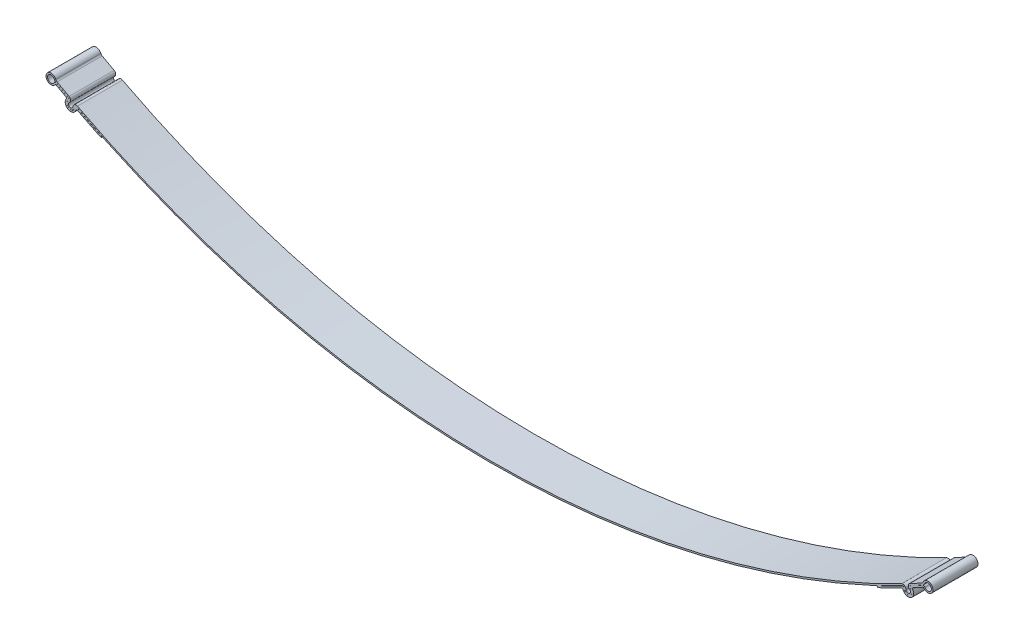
ISO-10303-21;
HEADER;
FILE_DESCRIPTION(('STEP AP214'),'2;1');
FILE_NAME('part.step','',(''),(''),'','','');
FILE_SCHEMA(('AUTOMOTIVE_DESIGN { 1 0 10303 214 1 1 1 1 }'));
ENDSEC;
DATA;
#1=APPLICATION_CONTEXT('core data for automotive mechanical design processes');
#2=APPLICATION_PROTOCOL_DEFINITION('international standard','automotive_design',2000,#1);
#3=PRODUCT_CONTEXT('',#1,'mechanical');
#4=PRODUCT('Part','Part','',(#3));
#5=PRODUCT_RELATED_PRODUCT_CATEGORY('part','',(#4));
#6=PRODUCT_DEFINITION_FORMATION('','',#4);
#7=PRODUCT_DEFINITION_CONTEXT('part definition',#1,'design');
#8=PRODUCT_DEFINITION('design','',#6,#7);
#9=PRODUCT_DEFINITION_SHAPE('','',#8);
#10=(LENGTH_UNIT() NAMED_UNIT(*) SI_UNIT(.MILLI.,.METRE.));
#11=(NAMED_UNIT(*) PLANE_ANGLE_UNIT() SI_UNIT($,.RADIAN.));
#12=(NAMED_UNIT(*) SI_UNIT($,.STERADIAN.) SOLID_ANGLE_UNIT());
#13=UNCERTAINTY_MEASURE_WITH_UNIT(LENGTH_MEASURE(1.E-05),#10,'distance_accuracy_value','');
#14=(GEOMETRIC_REPRESENTATION_CONTEXT(3) GLOBAL_UNCERTAINTY_ASSIGNED_CONTEXT((#13)) GLOBAL_UNIT_ASSIGNED_CONTEXT((#10,
#11,#12)) REPRESENTATION_CONTEXT('',''));
#15=CARTESIAN_POINT('',(0.,0.,0.));
#16=DIRECTION('',(0.,0.,1.));
#17=DIRECTION('',(1.,0.,0.));
#18=AXIS2_PLACEMENT_3D('',#15,#16,#17);
#19=CARTESIAN_POINT('',(7.87457238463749,-5.14219808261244,12.7));
#20=DIRECTION('',(0.,0.,-1.));
#21=DIRECTION('',(-1.,0.,0.));
#22=AXIS2_PLACEMENT_3D('',#19,#20,#21);
#23=CYLINDRICAL_SURFACE('',#22,0.762000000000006);
#24=CARTESIAN_POINT('',(7.87457238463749,-5.14219808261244,-12.7));
#25=DIRECTION('',(0.,0.,1.));
#26=DIRECTION('',(1.,0.,0.));
#27=AXIS2_PLACEMENT_3D('',#24,#25,#26);
#28=CIRCLE('',#27,0.762000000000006);
#29=CARTESIAN_POINT('',(8.50299784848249,-5.57315682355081,-12.7));
#30=VERTEX_POINT('',#29);
#31=CARTESIAN_POINT('',(8.23344509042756,-4.46999693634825,-12.7));
#32=VERTEX_POINT('',#31);
#33=EDGE_CURVE('E242',#30,#32,#28,.T.);
#34=ORIENTED_EDGE('',*,*,#33,.F.);
#35=DIRECTION('',(0.,0.,-1.));
#36=VECTOR('',#35,1.);
#37=CARTESIAN_POINT('',(8.50299784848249,-5.57315682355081,12.7));
#38=LINE('',#37,#36);
#39=CARTESIAN_POINT('',(8.50299784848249,-5.57315682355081,12.7));
#40=VERTEX_POINT('',#39);
#41=EDGE_CURVE('E11',#40,#30,#38,.T.);
#42=ORIENTED_EDGE('',*,*,#41,.F.);
#43=CARTESIAN_POINT('',(7.87457238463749,-5.14219808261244,12.7));
#44=DIRECTION('',(0.,0.,1.));
#45=DIRECTION('',(1.,0.,0.));
#46=AXIS2_PLACEMENT_3D('',#43,#44,#45);
#47=CIRCLE('',#46,0.762000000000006);
#48=CARTESIAN_POINT('',(8.23344509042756,-4.46999693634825,12.7));
#49=VERTEX_POINT('',#48);
#50=EDGE_CURVE('E317',#40,#49,#47,.T.);
#51=ORIENTED_EDGE('',*,*,#50,.T.);
#52=DIRECTION('',(0.,0.,-1.));
#53=VECTOR('',#52,1.);
#54=CARTESIAN_POINT('',(8.23344509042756,-4.46999693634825,12.7));
#55=LINE('',#54,#53);
#56=EDGE_CURVE('E143',#49,#32,#55,.T.);
#57=ORIENTED_EDGE('',*,*,#56,.T.);
#58=EDGE_LOOP('',(#34,#42,#51,#57));
#59=FACE_BOUND('',#58,.T.);
#60=ADVANCED_FACE('F37',(#59),#23,.F.);
#61=CARTESIAN_POINT('',(11.0585947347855,-7.32572237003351,12.7));
#62=DIRECTION('',(0.,0.,-1.));
#63=DIRECTION('',(-1.,0.,0.));
#64=AXIS2_PLACEMENT_3D('',#61,#62,#63);
#65=CYLINDRICAL_SURFACE('',#64,3.0988);
#66=CARTESIAN_POINT('',(11.0585947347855,-7.32572237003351,-12.7));
#67=DIRECTION('',(0.,0.,1.));
#68=DIRECTION('',(1.,0.,0.));
#69=AXIS2_PLACEMENT_3D('',#66,#67,#68);
#70=CIRCLE('',#69,3.0988);
#71=CARTESIAN_POINT('',(13.9536990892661,-8.43068038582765,-12.7));
#72=VERTEX_POINT('',#71);
#73=EDGE_CURVE('E245',#30,#72,#70,.T.);
#74=ORIENTED_EDGE('',*,*,#73,.T.);
#75=DIRECTION('',(0.,0.,-1.));
#76=VECTOR('',#75,1.);
#77=CARTESIAN_POINT('',(13.9536990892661,-8.43068038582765,12.7));
#78=LINE('',#77,#76);
#79=CARTESIAN_POINT('',(13.9536990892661,-8.43068038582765,12.7));
#80=VERTEX_POINT('',#79);
#81=EDGE_CURVE('E45',#80,#72,#78,.T.);
#82=ORIENTED_EDGE('',*,*,#81,.F.);
#83=CARTESIAN_POINT('',(11.0585947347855,-7.32572237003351,12.7));
#84=DIRECTION('',(0.,0.,1.));
#85=DIRECTION('',(1.,0.,0.));
#86=AXIS2_PLACEMENT_3D('',#83,#84,#85);
#87=CIRCLE('',#86,3.0988);
#88=EDGE_CURVE('E444',#40,#80,#87,.T.);
#89=ORIENTED_EDGE('',*,*,#88,.F.);
#90=ORIENTED_EDGE('',*,*,#41,.T.);
#91=EDGE_LOOP('',(#74,#82,#89,#90));
#92=FACE_BOUND('',#91,.T.);
#93=ADVANCED_FACE('F371',(#92),#65,.T.);
#94=CARTESIAN_POINT('',(14.6656099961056,-8.70239137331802,12.7));
#95=DIRECTION('',(0.,0.,-1.));
#96=DIRECTION('',(-1.,0.,0.));
#97=AXIS2_PLACEMENT_3D('',#94,#95,#96);
#98=CYLINDRICAL_SURFACE('',#97,0.762000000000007);
#99=CARTESIAN_POINT('',(14.6656099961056,-8.70239137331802,-12.7));
#100=DIRECTION('',(0.,0.,1.));
#101=DIRECTION('',(1.,0.,0.));
#102=AXIS2_PLACEMENT_3D('',#99,#100,#101);
#103=CIRCLE('',#102,0.762000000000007);
#104=CARTESIAN_POINT('',(15.0143291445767,-8.0248672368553,-12.7));
#105=VERTEX_POINT('',#104);
#106=EDGE_CURVE('E249',#105,#72,#103,.T.);
#107=ORIENTED_EDGE('',*,*,#106,.F.);
#108=DIRECTION('',(0.,0.,-1.));
#109=VECTOR('',#108,1.);
#110=CARTESIAN_POINT('',(15.0143291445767,-8.0248672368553,12.7));
#111=LINE('',#110,#109);
#112=CARTESIAN_POINT('',(15.0143291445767,-8.0248672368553,12.7));
#113=VERTEX_POINT('',#112);
#114=EDGE_CURVE('E361',#113,#105,#111,.T.);
#115=ORIENTED_EDGE('',*,*,#114,.F.);
#116=CARTESIAN_POINT('',(14.6656099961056,-8.70239137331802,12.7));
#117=DIRECTION('',(0.,0.,1.));
#118=DIRECTION('',(1.,0.,0.));
#119=AXIS2_PLACEMENT_3D('',#116,#117,#118);
#120=CIRCLE('',#119,0.762000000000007);
#121=EDGE_CURVE('E368',#113,#80,#120,.T.);
#122=ORIENTED_EDGE('',*,*,#121,.T.);
#123=ORIENTED_EDGE('',*,*,#81,.T.);
#124=EDGE_LOOP('',(#107,#115,#122,#123));
#125=FACE_BOUND('',#124,.T.);
#126=ADVANCED_FACE('F366',(#125),#98,.F.);
#127=CARTESIAN_POINT('',(247.900601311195,444.448336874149,12.7));
#128=DIRECTION('',(0.,0.,-1.));
#129=DIRECTION('',(-1.,0.,0.));
#130=AXIS2_PLACEMENT_3D('',#127,#128,#129);
#131=CYLINDRICAL_SURFACE('',#130,508.889001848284);
#132=CARTESIAN_POINT('',(247.900601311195,444.448336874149,-12.7));
#133=DIRECTION('',(0.,0.,1.));
#134=DIRECTION('',(1.,0.,0.));
#135=AXIS2_PLACEMENT_3D('',#132,#133,#134);
#136=CIRCLE('',#135,508.889001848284);
#137=CARTESIAN_POINT('',(28.2202048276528,-14.5816617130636,-12.7));
#138=VERTEX_POINT('',#137);
#139=EDGE_CURVE('E252',#105,#138,#136,.T.);
#140=ORIENTED_EDGE('',*,*,#139,.T.);
#141=DIRECTION('',(0.,0.,-1.));
#142=VECTOR('',#141,1.);
#143=CARTESIAN_POINT('',(28.2202048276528,-14.5816617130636,12.7));
#144=LINE('',#143,#142);
#145=CARTESIAN_POINT('',(28.2202048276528,-14.5816617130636,12.7));
#146=VERTEX_POINT('',#145);
#147=EDGE_CURVE('E358',#146,#138,#144,.T.);
#148=ORIENTED_EDGE('',*,*,#147,.F.);
#149=CARTESIAN_POINT('',(247.900601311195,444.448336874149,12.7));
#150=DIRECTION('',(0.,0.,1.));
#151=DIRECTION('',(1.,0.,0.));
#152=AXIS2_PLACEMENT_3D('',#149,#150,#151);
#153=CIRCLE('',#152,508.889001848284);
#154=EDGE_CURVE('E388',#113,#146,#153,.T.);
#155=ORIENTED_EDGE('',*,*,#154,.F.);
#156=ORIENTED_EDGE('',*,*,#114,.T.);
#157=EDGE_LOOP('',(#140,#148,#155,#156));
#158=FACE_BOUND('',#157,.T.);
#159=ADVANCED_FACE('F378',(#158),#131,.T.);
#160=CARTESIAN_POINT('',(28.63925610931,-13.7060391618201,12.7));
#161=DIRECTION('',(-0.902023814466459,0.431686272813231,0.));
#162=DIRECTION('',(-0.431686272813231,-0.902023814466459,0.));
#163=AXIS2_PLACEMENT_3D('',#160,#161,#162);
#164=PLANE('',#163);
#165=DIRECTION('',(0.431686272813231,0.902023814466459,0.));
#166=VECTOR('',#165,1.);
#167=CARTESIAN_POINT('',(28.63925610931,-13.7060391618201,-12.7));
#168=LINE('',#167,#166);
#169=CARTESIAN_POINT('',(28.6039737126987,-13.7797629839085,-12.7));
#170=VERTEX_POINT('',#169);
#171=EDGE_CURVE('E254',#138,#170,#168,.T.);
#172=ORIENTED_EDGE('',*,*,#171,.T.);
#173=DIRECTION('',(0.,0.,-1.));
#174=VECTOR('',#173,1.);
#175=CARTESIAN_POINT('',(28.6039737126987,-13.7797629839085,12.7));
#176=LINE('',#175,#174);
#177=CARTESIAN_POINT('',(28.6039737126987,-13.7797629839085,12.7));
#178=VERTEX_POINT('',#177);
#179=EDGE_CURVE('E356',#178,#170,#176,.T.);
#180=ORIENTED_EDGE('',*,*,#179,.F.);
#181=DIRECTION('',(0.431686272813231,0.902023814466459,0.));
#182=VECTOR('',#181,1.);
#183=CARTESIAN_POINT('',(28.63925610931,-13.7060391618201,12.7));
#184=LINE('',#183,#182);
#185=EDGE_CURVE('E384',#146,#178,#184,.T.);
#186=ORIENTED_EDGE('',*,*,#185,.F.);
#187=ORIENTED_EDGE('',*,*,#147,.T.);
#188=EDGE_LOOP('',(#172,#180,#186,#187));
#189=FACE_BOUND('',#188,.T.);
#190=ADVANCED_FACE('F382',(#189),#164,.F.);
#191=CARTESIAN_POINT('',(247.900601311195,444.448336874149,12.7));
#192=DIRECTION('',(0.,0.,-1.));
#193=DIRECTION('',(-1.,0.,0.));
#194=AXIS2_PLACEMENT_3D('',#191,#192,#193);
#195=CYLINDRICAL_SURFACE('',#194,508.000002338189);
#196=CARTESIAN_POINT('',(247.900601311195,444.448336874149,-12.7));
#197=DIRECTION('',(0.,0.,1.));
#198=DIRECTION('',(1.,0.,0.));
#199=AXIS2_PLACEMENT_3D('',#196,#197,#198);
#200=CIRCLE('',#199,508.000002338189);
#201=CARTESIAN_POINT('',(14.380281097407,-6.6971634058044,-12.7));
#202=VERTEX_POINT('',#201);
#203=EDGE_CURVE('E257',#202,#170,#200,.T.);
#204=ORIENTED_EDGE('',*,*,#203,.F.);
#205=DIRECTION('',(0.,0.,-1.));
#206=VECTOR('',#205,1.);
#207=CARTESIAN_POINT('',(14.380281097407,-6.6971634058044,12.7));
#208=LINE('',#207,#206);
#209=CARTESIAN_POINT('',(14.380281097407,-6.6971634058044,12.7));
#210=VERTEX_POINT('',#209);
#211=EDGE_CURVE('E354',#210,#202,#208,.T.);
#212=ORIENTED_EDGE('',*,*,#211,.F.);
#213=CARTESIAN_POINT('',(247.900601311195,444.448336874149,12.7));
#214=DIRECTION('',(0.,0.,1.));
#215=DIRECTION('',(1.,0.,0.));
#216=AXIS2_PLACEMENT_3D('',#213,#214,#215);
#217=CIRCLE('',#216,508.000002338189);
#218=EDGE_CURVE('E387',#210,#178,#217,.T.);
#219=ORIENTED_EDGE('',*,*,#218,.T.);
#220=ORIENTED_EDGE('',*,*,#179,.T.);
#221=EDGE_LOOP('',(#204,#212,#219,#220));
#222=FACE_BOUND('',#221,.T.);
#223=ADVANCED_FACE('F923',(#222),#195,.F.);
#224=CARTESIAN_POINT('',(14.0300016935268,-7.37387957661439,12.7));
#225=DIRECTION('',(0.,0.,-1.));
#226=DIRECTION('',(-1.,0.,0.));
#227=AXIS2_PLACEMENT_3D('',#224,#225,#226);
#228=CYLINDRICAL_SURFACE('',#227,0.761997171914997);
#229=CARTESIAN_POINT('',(14.0300016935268,-7.37387957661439,-12.7));
#230=DIRECTION('',(0.,0.,1.));
#231=DIRECTION('',(1.,0.,0.));
#232=AXIS2_PLACEMENT_3D('',#229,#230,#231);
#233=CIRCLE('',#232,0.761997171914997);
#234=CARTESIAN_POINT('',(13.2681045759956,-7.36153160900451,-12.7));
#235=VERTEX_POINT('',#234);
#236=EDGE_CURVE('E260',#202,#235,#233,.T.);
#237=ORIENTED_EDGE('',*,*,#236,.T.);
#238=DIRECTION('',(0.,0.,-1.));
#239=VECTOR('',#238,1.);
#240=CARTESIAN_POINT('',(13.2681045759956,-7.36153160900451,12.7));
#241=LINE('',#240,#239);
#242=CARTESIAN_POINT('',(13.2681045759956,-7.36153160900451,12.7));
#243=VERTEX_POINT('',#242);
#244=EDGE_CURVE('E352',#243,#235,#241,.T.);
#245=ORIENTED_EDGE('',*,*,#244,.F.);
#246=CARTESIAN_POINT('',(14.0300016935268,-7.37387957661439,12.7));
#247=DIRECTION('',(0.,0.,1.));
#248=DIRECTION('',(1.,0.,0.));
#249=AXIS2_PLACEMENT_3D('',#246,#247,#248);
#250=CIRCLE('',#249,0.761997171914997);
#251=EDGE_CURVE('E390',#210,#243,#250,.T.);
#252=ORIENTED_EDGE('',*,*,#251,.F.);
#253=ORIENTED_EDGE('',*,*,#211,.T.);
#254=EDGE_LOOP('',(#237,#245,#252,#253));
#255=FACE_BOUND('',#254,.T.);
#256=ADVANCED_FACE('F925',(#255),#228,.T.);
#257=CARTESIAN_POINT('',(11.0585947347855,-7.32572237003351,12.7));
#258=DIRECTION('',(0.,0.,-1.));
#259=DIRECTION('',(-1.,0.,0.));
#260=AXIS2_PLACEMENT_3D('',#257,#258,#259);
#261=CYLINDRICAL_SURFACE('',#260,2.2098);
#262=CARTESIAN_POINT('',(11.0585947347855,-7.32572237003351,-12.7));
#263=DIRECTION('',(0.,0.,1.));
#264=DIRECTION('',(1.,0.,0.));
#265=AXIS2_PLACEMENT_3D('',#262,#263,#264);
#266=CIRCLE('',#265,2.2098);
#267=CARTESIAN_POINT('',(9.77231155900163,-5.52886632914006,-12.7));
#268=VERTEX_POINT('',#267);
#269=EDGE_CURVE('E263',#268,#235,#266,.T.);
#270=ORIENTED_EDGE('',*,*,#269,.F.);
#271=DIRECTION('',(0.,0.,-1.));
#272=VECTOR('',#271,1.);
#273=CARTESIAN_POINT('',(9.77231155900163,-5.52886632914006,12.7));
#274=LINE('',#273,#272);
#275=CARTESIAN_POINT('',(9.77231155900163,-5.52886632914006,12.7));
#276=VERTEX_POINT('',#275);
#277=EDGE_CURVE('E350',#276,#268,#274,.T.);
#278=ORIENTED_EDGE('',*,*,#277,.F.);
#279=CARTESIAN_POINT('',(11.0585947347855,-7.32572237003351,12.7));
#280=DIRECTION('',(0.,0.,1.));
#281=DIRECTION('',(1.,0.,0.));
#282=AXIS2_PLACEMENT_3D('',#279,#280,#281);
#283=CIRCLE('',#282,2.2098);
#284=EDGE_CURVE('E396',#276,#243,#283,.T.);
#285=ORIENTED_EDGE('',*,*,#284,.T.);
#286=ORIENTED_EDGE('',*,*,#244,.T.);
#287=EDGE_LOOP('',(#270,#278,#285,#286));
#288=FACE_BOUND('',#287,.T.);
#289=ADVANCED_FACE('F917',(#288),#261,.F.);
#290=CARTESIAN_POINT('',(9.32876728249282,-4.9092630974,12.7));
#291=DIRECTION('',(0.,0.,-1.));
#292=DIRECTION('',(-1.,0.,0.));
#293=AXIS2_PLACEMENT_3D('',#290,#291,#292);
#294=CYLINDRICAL_SURFACE('',#293,0.761997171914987);
#295=CARTESIAN_POINT('',(9.32876728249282,-4.9092630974,-12.7));
#296=DIRECTION('',(0.,0.,1.));
#297=DIRECTION('',(1.,0.,0.));
#298=AXIS2_PLACEMENT_3D('',#295,#296,#297);
#299=CIRCLE('',#298,0.761997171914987);
#300=CARTESIAN_POINT('',(9.68608795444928,-4.23623830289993,-12.7));
#301=VERTEX_POINT('',#300);
#302=EDGE_CURVE('E266',#268,#301,#299,.T.);
#303=ORIENTED_EDGE('',*,*,#302,.T.);
#304=DIRECTION('',(0.,0.,-1.));
#305=VECTOR('',#304,1.);
#306=CARTESIAN_POINT('',(9.68608795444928,-4.23623830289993,12.7));
#307=LINE('',#306,#305);
#308=CARTESIAN_POINT('',(9.68608795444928,-4.23623830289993,12.7));
#309=VERTEX_POINT('',#308);
#310=EDGE_CURVE('E348',#309,#301,#307,.T.);
#311=ORIENTED_EDGE('',*,*,#310,.F.);
#312=CARTESIAN_POINT('',(9.32876728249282,-4.9092630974,12.7));
#313=DIRECTION('',(0.,0.,1.));
#314=DIRECTION('',(1.,0.,0.));
#315=AXIS2_PLACEMENT_3D('',#312,#313,#314);
#316=CIRCLE('',#315,0.761997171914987);
#317=EDGE_CURVE('E399',#276,#309,#316,.T.);
#318=ORIENTED_EDGE('',*,*,#317,.F.);
#319=ORIENTED_EDGE('',*,*,#277,.T.);
#320=EDGE_LOOP('',(#303,#311,#318,#319));
#321=FACE_BOUND('',#320,.T.);
#322=ADVANCED_FACE('F914',(#321),#294,.T.);
#323=CARTESIAN_POINT('',(247.900601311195,444.448336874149,12.7));
#324=DIRECTION('',(0.,0.,-1.));
#325=DIRECTION('',(-1.,0.,0.));
#326=AXIS2_PLACEMENT_3D('',#323,#324,#325);
#327=CYLINDRICAL_SURFACE('',#326,508.000002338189);
#328=CARTESIAN_POINT('',(247.900601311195,444.448336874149,-12.7));
#329=DIRECTION('',(0.,0.,1.));
#330=DIRECTION('',(1.,0.,0.));
#331=AXIS2_PLACEMENT_3D('',#328,#329,#330);
#332=CIRCLE('',#331,508.000002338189);
#333=CARTESIAN_POINT('',(2.95022793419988,-0.594713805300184,-12.7));
#334=VERTEX_POINT('',#333);
#335=EDGE_CURVE('E269',#334,#301,#332,.T.);
#336=ORIENTED_EDGE('',*,*,#335,.F.);
#337=DIRECTION('',(0.,0.,-1.));
#338=VECTOR('',#337,1.);
#339=CARTESIAN_POINT('',(2.95022793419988,-0.594713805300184,12.7));
#340=LINE('',#339,#338);
#341=CARTESIAN_POINT('',(2.95022793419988,-0.594713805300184,12.7));
#342=VERTEX_POINT('',#341);
#343=EDGE_CURVE('E346',#342,#334,#340,.T.);
#344=ORIENTED_EDGE('',*,*,#343,.F.);
#345=CARTESIAN_POINT('',(247.900601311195,444.448336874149,12.7));
#346=DIRECTION('',(0.,0.,1.));
#347=DIRECTION('',(1.,0.,0.));
#348=AXIS2_PLACEMENT_3D('',#345,#346,#347);
#349=CIRCLE('',#348,508.000002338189);
#350=EDGE_CURVE('E401',#342,#309,#349,.T.);
#351=ORIENTED_EDGE('',*,*,#350,.T.);
#352=ORIENTED_EDGE('',*,*,#310,.T.);
#353=EDGE_LOOP('',(#336,#344,#351,#352));
#354=FACE_BOUND('',#353,.T.);
#355=ADVANCED_FACE('F909',(#354),#327,.F.);
#356=CARTESIAN_POINT('',(2.52099207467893,-1.37457967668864,12.7));
#357=DIRECTION('',(0.,0.,-1.));
#358=DIRECTION('',(-1.,0.,0.));
#359=AXIS2_PLACEMENT_3D('',#356,#357,#358);
#360=CYLINDRICAL_SURFACE('',#359,0.890188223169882);
#361=CARTESIAN_POINT('',(2.52099207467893,-1.37457967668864,-12.7));
#362=DIRECTION('',(0.,0.,1.));
#363=DIRECTION('',(1.,0.,0.));
#364=AXIS2_PLACEMENT_3D('',#361,#362,#363);
#365=CIRCLE('',#364,0.890188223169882);
#366=CARTESIAN_POINT('',(1.73943371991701,-0.948432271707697,-12.7));
#367=VERTEX_POINT('',#366);
#368=EDGE_CURVE('E272',#367,#334,#365,.F.);
#369=ORIENTED_EDGE('',*,*,#368,.F.);
#370=DIRECTION('',(0.,0.,-1.));
#371=VECTOR('',#370,1.);
#372=CARTESIAN_POINT('',(1.73943371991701,-0.948432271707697,12.7));
#373=LINE('',#372,#371);
#374=CARTESIAN_POINT('',(1.73943371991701,-0.948432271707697,12.7));
#375=VERTEX_POINT('',#374);
#376=EDGE_CURVE('E344',#375,#367,#373,.T.);
#377=ORIENTED_EDGE('',*,*,#376,.F.);
#378=CARTESIAN_POINT('',(2.52099207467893,-1.37457967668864,12.7));
#379=DIRECTION('',(0.,0.,1.));
#380=DIRECTION('',(1.,0.,0.));
#381=AXIS2_PLACEMENT_3D('',#378,#379,#380);
#382=CIRCLE('',#381,0.890188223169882);
#383=EDGE_CURVE('E404',#375,#342,#382,.F.);
#384=ORIENTED_EDGE('',*,*,#383,.T.);
#385=ORIENTED_EDGE('',*,*,#343,.T.);
#386=EDGE_LOOP('',(#369,#377,#384,#385));
#387=FACE_BOUND('',#386,.T.);
#388=ADVANCED_FACE('F904',(#387),#360,.T.);
#389=CARTESIAN_POINT('',(0.,0.,12.7));
#390=DIRECTION('',(0.,0.,-1.));
#391=DIRECTION('',(-1.,0.,0.));
#392=AXIS2_PLACEMENT_3D('',#389,#390,#391);
#393=CYLINDRICAL_SURFACE('',#392,1.98120000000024);
#394=CARTESIAN_POINT('',(0.,0.,-12.7));
#395=DIRECTION('',(0.,0.,1.));
#396=DIRECTION('',(1.,0.,0.));
#397=AXIS2_PLACEMENT_3D('',#394,#395,#396);
#398=CIRCLE('',#397,1.98120000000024);
#399=CARTESIAN_POINT('',(1.84021980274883,0.73399217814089,-12.7));
#400=VERTEX_POINT('',#399);
#401=EDGE_CURVE('E275',#400,#367,#398,.T.);
#402=ORIENTED_EDGE('',*,*,#401,.F.);
#403=DIRECTION('',(0.,0.,-1.));
#404=VECTOR('',#403,1.);
#405=CARTESIAN_POINT('',(1.84021980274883,0.73399217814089,12.7));
#406=LINE('',#405,#404);
#407=CARTESIAN_POINT('',(1.84021980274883,0.73399217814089,12.7));
#408=VERTEX_POINT('',#407);
#409=EDGE_CURVE('E342',#408,#400,#406,.T.);
#410=ORIENTED_EDGE('',*,*,#409,.F.);
#411=CARTESIAN_POINT('',(0.,0.,12.7));
#412=DIRECTION('',(0.,0.,1.));
#413=DIRECTION('',(1.,0.,0.));
#414=AXIS2_PLACEMENT_3D('',#411,#412,#413);
#415=CIRCLE('',#414,1.98120000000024);
#416=EDGE_CURVE('E407',#408,#375,#415,.T.);
#417=ORIENTED_EDGE('',*,*,#416,.T.);
#418=ORIENTED_EDGE('',*,*,#376,.T.);
#419=EDGE_LOOP('',(#402,#410,#417,#418));
#420=FACE_BOUND('',#419,.T.);
#421=ADVANCED_FACE('F898',(#420),#393,.F.);
#422=CARTESIAN_POINT('',(4.19947596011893,1.67500779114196,12.7));
#423=DIRECTION('',(0.,0.,-1.));
#424=DIRECTION('',(-1.,0.,0.));
#425=AXIS2_PLACEMENT_3D('',#422,#423,#424);
#426=CYLINDRICAL_SURFACE('',#425,2.54000000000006);
#427=CARTESIAN_POINT('',(4.19947596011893,1.67500779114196,-12.7));
#428=DIRECTION('',(0.,0.,1.));
#429=DIRECTION('',(1.,0.,0.));
#430=AXIS2_PLACEMENT_3D('',#427,#428,#429);
#431=CIRCLE('',#430,2.54000000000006);
#432=CARTESIAN_POINT('',(2.97472341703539,-0.550208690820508,-12.7));
#433=VERTEX_POINT('',#432);
#434=EDGE_CURVE('E278',#400,#433,#431,.T.);
#435=ORIENTED_EDGE('',*,*,#434,.T.);
#436=DIRECTION('',(0.,0.,-1.));
#437=VECTOR('',#436,1.);
#438=CARTESIAN_POINT('',(2.97472341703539,-0.550208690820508,12.7));
#439=LINE('',#438,#437);
#440=CARTESIAN_POINT('',(2.97472341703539,-0.550208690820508,12.7));
#441=VERTEX_POINT('',#440);
#442=EDGE_CURVE('E339',#441,#433,#439,.T.);
#443=ORIENTED_EDGE('',*,*,#442,.F.);
#444=CARTESIAN_POINT('',(4.19947596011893,1.67500779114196,12.7));
#445=DIRECTION('',(0.,0.,1.));
#446=DIRECTION('',(1.,0.,0.));
#447=AXIS2_PLACEMENT_3D('',#444,#445,#446);
#448=CIRCLE('',#447,2.54000000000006);
#449=EDGE_CURVE('E410',#408,#441,#448,.T.);
#450=ORIENTED_EDGE('',*,*,#449,.F.);
#451=ORIENTED_EDGE('',*,*,#409,.T.);
#452=EDGE_LOOP('',(#435,#443,#450,#451));
#453=FACE_BOUND('',#452,.T.);
#454=ADVANCED_FACE('F999',(#453),#426,.T.);
#455=CARTESIAN_POINT('',(247.900601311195,444.448336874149,12.7));
#456=DIRECTION('',(0.,0.,-1.));
#457=DIRECTION('',(-1.,0.,0.));
#458=AXIS2_PLACEMENT_3D('',#455,#456,#457);
#459=CYLINDRICAL_SURFACE('',#458,507.949201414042);
#460=CARTESIAN_POINT('',(247.900601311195,444.448336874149,-12.7));
#461=DIRECTION('',(0.,0.,1.));
#462=DIRECTION('',(1.,0.,0.));
#463=AXIS2_PLACEMENT_3D('',#460,#461,#462);
#464=CIRCLE('',#463,507.949201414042);
#465=CARTESIAN_POINT('',(9.70990983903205,-4.19136902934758,-12.7));
#466=VERTEX_POINT('',#465);
#467=EDGE_CURVE('E280',#433,#466,#464,.T.);
#468=ORIENTED_EDGE('',*,*,#467,.T.);
#469=DIRECTION('',(0.,0.,-1.));
#470=VECTOR('',#469,1.);
#471=CARTESIAN_POINT('',(9.70990983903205,-4.19136902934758,12.7));
#472=LINE('',#471,#470);
#473=CARTESIAN_POINT('',(9.70990983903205,-4.19136902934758,12.7));
#474=VERTEX_POINT('',#473);
#475=EDGE_CURVE('E337',#474,#466,#472,.T.);
#476=ORIENTED_EDGE('',*,*,#475,.F.);
#477=CARTESIAN_POINT('',(247.900601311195,444.448336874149,12.7));
#478=DIRECTION('',(0.,0.,1.));
#479=DIRECTION('',(1.,0.,0.));
#480=AXIS2_PLACEMENT_3D('',#477,#478,#479);
#481=CIRCLE('',#480,507.949201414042);
#482=EDGE_CURVE('E412',#441,#474,#481,.T.);
#483=ORIENTED_EDGE('',*,*,#482,.F.);
#484=ORIENTED_EDGE('',*,*,#442,.T.);
#485=EDGE_LOOP('',(#468,#476,#483,#484));
#486=FACE_BOUND('',#485,.T.);
#487=ADVANCED_FACE('F892',(#486),#459,.T.);
#488=CARTESIAN_POINT('',(9.32876728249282,-4.9092630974,12.7));
#489=DIRECTION('',(0.,0.,-1.));
#490=DIRECTION('',(-1.,0.,0.));
#491=AXIS2_PLACEMENT_3D('',#488,#489,#490);
#492=CYLINDRICAL_SURFACE('',#491,0.812797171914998);
#493=CARTESIAN_POINT('',(9.32876728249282,-4.9092630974,-12.7));
#494=DIRECTION('',(0.,0.,1.));
#495=DIRECTION('',(1.,0.,0.));
#496=AXIS2_PLACEMENT_3D('',#493,#494,#495);
#497=CIRCLE('',#496,0.812797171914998);
#498=CARTESIAN_POINT('',(9.80188128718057,-5.5701733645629,-12.7));
#499=VERTEX_POINT('',#498);
#500=EDGE_CURVE('E283',#499,#466,#497,.T.);
#501=ORIENTED_EDGE('',*,*,#500,.F.);
#502=DIRECTION('',(0.,0.,-1.));
#503=VECTOR('',#502,1.);
#504=CARTESIAN_POINT('',(9.80188128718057,-5.5701733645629,12.7));
#505=LINE('',#504,#503);
#506=CARTESIAN_POINT('',(9.80188128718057,-5.5701733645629,12.7));
#507=VERTEX_POINT('',#506);
#508=EDGE_CURVE('E335',#507,#499,#505,.T.);
#509=ORIENTED_EDGE('',*,*,#508,.F.);
#510=CARTESIAN_POINT('',(9.32876728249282,-4.9092630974,12.7));
#511=DIRECTION('',(0.,0.,1.));
#512=DIRECTION('',(1.,0.,0.));
#513=AXIS2_PLACEMENT_3D('',#510,#511,#512);
#514=CIRCLE('',#513,0.812797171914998);
#515=EDGE_CURVE('E414',#507,#474,#514,.T.);
#516=ORIENTED_EDGE('',*,*,#515,.T.);
#517=ORIENTED_EDGE('',*,*,#475,.T.);
#518=EDGE_LOOP('',(#501,#509,#516,#517));
#519=FACE_BOUND('',#518,.T.);
#520=ADVANCED_FACE('F887',(#519),#492,.F.);
#521=CARTESIAN_POINT('',(11.0585947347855,-7.32572237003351,12.7));
#522=DIRECTION('',(0.,0.,-1.));
#523=DIRECTION('',(-1.,0.,0.));
#524=AXIS2_PLACEMENT_3D('',#521,#522,#523);
#525=CYLINDRICAL_SURFACE('',#524,2.15899999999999);
#526=CARTESIAN_POINT('',(11.0585947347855,-7.32572237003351,-12.7));
#527=DIRECTION('',(0.,0.,1.));
#528=DIRECTION('',(1.,0.,0.));
#529=AXIS2_PLACEMENT_3D('',#526,#527,#528);
#530=CIRCLE('',#529,2.15899999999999);
#531=CARTESIAN_POINT('',(13.2173112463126,-7.36070840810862,-12.7));
#532=VERTEX_POINT('',#531);
#533=EDGE_CURVE('E286',#499,#532,#530,.T.);
#534=ORIENTED_EDGE('',*,*,#533,.T.);
#535=DIRECTION('',(0.,0.,-1.));
#536=VECTOR('',#535,1.);
#537=CARTESIAN_POINT('',(13.2173112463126,-7.36070840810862,12.7));
#538=LINE('',#537,#536);
#539=CARTESIAN_POINT('',(13.2173112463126,-7.36070840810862,12.7));
#540=VERTEX_POINT('',#539);
#541=EDGE_CURVE('E333',#540,#532,#538,.T.);
#542=ORIENTED_EDGE('',*,*,#541,.F.);
#543=CARTESIAN_POINT('',(11.0585947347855,-7.32572237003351,12.7));
#544=DIRECTION('',(0.,0.,1.));
#545=DIRECTION('',(1.,0.,0.));
#546=AXIS2_PLACEMENT_3D('',#543,#544,#545);
#547=CIRCLE('',#546,2.15899999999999);
#548=EDGE_CURVE('E417',#507,#540,#547,.T.);
#549=ORIENTED_EDGE('',*,*,#548,.F.);
#550=ORIENTED_EDGE('',*,*,#508,.T.);
#551=EDGE_LOOP('',(#534,#542,#549,#550));
#552=FACE_BOUND('',#551,.T.);
#553=ADVANCED_FACE('F883',(#552),#525,.T.);
#554=CARTESIAN_POINT('',(14.0300016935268,-7.37387957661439,12.7));
#555=DIRECTION('',(0.,0.,-1.));
#556=DIRECTION('',(-1.,0.,0.));
#557=AXIS2_PLACEMENT_3D('',#554,#555,#556);
#558=CYLINDRICAL_SURFACE('',#557,0.812797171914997);
#559=CARTESIAN_POINT('',(14.0300016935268,-7.37387957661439,-12.7));
#560=DIRECTION('',(0.,0.,1.));
#561=DIRECTION('',(1.,0.,0.));
#562=AXIS2_PLACEMENT_3D('',#559,#560,#561);
#563=CIRCLE('',#562,0.812797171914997);
#564=CARTESIAN_POINT('',(14.403633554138,-6.65204803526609,-12.7));
#565=VERTEX_POINT('',#564);
#566=EDGE_CURVE('E289',#565,#532,#563,.T.);
#567=ORIENTED_EDGE('',*,*,#566,.F.);
#568=DIRECTION('',(0.,0.,-1.));
#569=VECTOR('',#568,1.);
#570=CARTESIAN_POINT('',(14.403633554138,-6.65204803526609,12.7));
#571=LINE('',#570,#569);
#572=CARTESIAN_POINT('',(14.403633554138,-6.65204803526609,12.7));
#573=VERTEX_POINT('',#572);
#574=EDGE_CURVE('E331',#573,#565,#571,.T.);
#575=ORIENTED_EDGE('',*,*,#574,.F.);
#576=CARTESIAN_POINT('',(14.0300016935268,-7.37387957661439,12.7));
#577=DIRECTION('',(0.,0.,1.));
#578=DIRECTION('',(1.,0.,0.));
#579=AXIS2_PLACEMENT_3D('',#576,#577,#578);
#580=CIRCLE('',#579,0.812797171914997);
#581=EDGE_CURVE('E419',#573,#540,#580,.T.);
#582=ORIENTED_EDGE('',*,*,#581,.T.);
#583=ORIENTED_EDGE('',*,*,#541,.T.);
#584=EDGE_LOOP('',(#567,#575,#582,#583));
#585=FACE_BOUND('',#584,.T.);
#586=ADVANCED_FACE('F879',(#585),#558,.F.);
#587=CARTESIAN_POINT('',(247.900601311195,444.448336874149,12.7));
#588=DIRECTION('',(0.,0.,-1.));
#589=DIRECTION('',(-1.,0.,0.));
#590=AXIS2_PLACEMENT_3D('',#587,#588,#589);
#591=CYLINDRICAL_SURFACE('',#590,507.949201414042);
#592=CARTESIAN_POINT('',(247.900601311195,444.448336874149,-12.7));
#593=DIRECTION('',(0.,0.,1.));
#594=DIRECTION('',(1.,0.,0.));
#595=AXIS2_PLACEMENT_3D('',#592,#593,#594);
#596=CIRCLE('',#595,507.949201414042);
#597=CARTESIAN_POINT('',(479.732783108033,-7.50988099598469,-12.7));
#598=VERTEX_POINT('',#597);
#599=EDGE_CURVE('E292',#565,#598,#596,.T.);
#600=ORIENTED_EDGE('',*,*,#599,.T.);
#601=DIRECTION('',(0.,0.,-1.));
#602=VECTOR('',#601,1.);
#603=CARTESIAN_POINT('',(479.732783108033,-7.50988099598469,12.7));
#604=LINE('',#603,#602);
#605=CARTESIAN_POINT('',(479.732783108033,-7.50988099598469,12.7));
#606=VERTEX_POINT('',#605);
#607=EDGE_CURVE('E495',#606,#598,#604,.T.);
#608=ORIENTED_EDGE('',*,*,#607,.F.);
#609=CARTESIAN_POINT('',(247.900601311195,444.448336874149,12.7));
#610=DIRECTION('',(0.,0.,1.));
#611=DIRECTION('',(1.,0.,0.));
#612=AXIS2_PLACEMENT_3D('',#609,#610,#611);
#613=CIRCLE('',#612,507.949201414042);
#614=EDGE_CURVE('E422',#573,#606,#613,.T.);
#615=ORIENTED_EDGE('',*,*,#614,.F.);
#616=ORIENTED_EDGE('',*,*,#574,.T.);
#617=EDGE_LOOP('',(#600,#608,#615,#616));
#618=FACE_BOUND('',#617,.T.);
#619=ADVANCED_FACE('F874',(#618),#591,.T.);
#620=CARTESIAN_POINT('',(247.900601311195,444.448336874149,12.7));
#621=DIRECTION('',(0.,0.,-1.));
#622=DIRECTION('',(-1.,0.,0.));
#623=AXIS2_PLACEMENT_3D('',#620,#621,#622);
#624=CYLINDRICAL_SURFACE('',#623,507.060201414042);
#625=CARTESIAN_POINT('',(247.900601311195,444.448336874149,-12.7));
#626=DIRECTION('',(0.,0.,1.));
#627=DIRECTION('',(1.,0.,0.));
#628=AXIS2_PLACEMENT_3D('',#625,#626,#627);
#629=CIRCLE('',#628,507.060201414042);
#630=CARTESIAN_POINT('',(14.8122934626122,-5.86254466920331,-12.7));
#631=VERTEX_POINT('',#630);
#632=CARTESIAN_POINT('',(479.327036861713,-6.71887627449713,-12.7));
#633=VERTEX_POINT('',#632);
#634=EDGE_CURVE('E295',#631,#633,#629,.T.);
#635=ORIENTED_EDGE('',*,*,#634,.F.);
#636=DIRECTION('',(0.,0.,-1.));
#637=VECTOR('',#636,1.);
#638=CARTESIAN_POINT('',(14.8122934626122,-5.86254466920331,12.7));
#639=LINE('',#638,#637);
#640=CARTESIAN_POINT('',(14.8122934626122,-5.86254466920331,12.7));
#641=VERTEX_POINT('',#640);
#642=EDGE_CURVE('E329',#641,#631,#639,.T.);
#643=ORIENTED_EDGE('',*,*,#642,.F.);
#644=CARTESIAN_POINT('',(247.900601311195,444.448336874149,12.7));
#645=DIRECTION('',(0.,0.,1.));
#646=DIRECTION('',(1.,0.,0.));
#647=AXIS2_PLACEMENT_3D('',#644,#645,#646);
#648=CIRCLE('',#647,507.060201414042);
#649=CARTESIAN_POINT('',(479.327036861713,-6.71887627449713,12.7));
#650=VERTEX_POINT('',#649);
#651=EDGE_CURVE('E425',#641,#650,#648,.T.);
#652=ORIENTED_EDGE('',*,*,#651,.T.);
#653=DIRECTION('',(0.,0.,-1.));
#654=VECTOR('',#653,1.);
#655=CARTESIAN_POINT('',(479.327036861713,-6.71887627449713,12.7));
#656=LINE('',#655,#654);
#657=EDGE_CURVE('E498',#650,#633,#656,.T.);
#658=ORIENTED_EDGE('',*,*,#657,.T.);
#659=EDGE_LOOP('',(#635,#643,#652,#658));
#660=FACE_BOUND('',#659,.T.);
#661=ADVANCED_FACE('F1049',(#660),#624,.F.);
#662=CARTESIAN_POINT('',(14.0300016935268,-7.37387957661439,12.7));
#663=DIRECTION('',(0.,0.,-1.));
#664=DIRECTION('',(-1.,0.,0.));
#665=AXIS2_PLACEMENT_3D('',#662,#663,#664);
#666=CYLINDRICAL_SURFACE('',#665,1.701797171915);
#667=CARTESIAN_POINT('',(14.0300016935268,-7.37387957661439,-12.7));
#668=DIRECTION('',(0.,0.,1.));
#669=DIRECTION('',(1.,0.,0.));
#670=AXIS2_PLACEMENT_3D('',#667,#668,#669);
#671=CIRCLE('',#670,1.701797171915);
#672=CARTESIAN_POINT('',(12.3284279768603,-7.34630239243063,-12.7));
#673=VERTEX_POINT('',#672);
#674=EDGE_CURVE('E298',#631,#673,#671,.T.);
#675=ORIENTED_EDGE('',*,*,#674,.T.);
#676=DIRECTION('',(0.,0.,-1.));
#677=VECTOR('',#676,1.);
#678=CARTESIAN_POINT('',(12.3284279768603,-7.34630239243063,12.7));
#679=LINE('',#678,#677);
#680=CARTESIAN_POINT('',(12.3284279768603,-7.34630239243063,12.7));
#681=VERTEX_POINT('',#680);
#682=EDGE_CURVE('E327',#681,#673,#679,.T.);
#683=ORIENTED_EDGE('',*,*,#682,.F.);
#684=CARTESIAN_POINT('',(14.0300016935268,-7.37387957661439,12.7));
#685=DIRECTION('',(0.,0.,1.));
#686=DIRECTION('',(1.,0.,0.));
#687=AXIS2_PLACEMENT_3D('',#684,#685,#686);
#688=CIRCLE('',#687,1.701797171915);
#689=EDGE_CURVE('E428',#641,#681,#688,.T.);
#690=ORIENTED_EDGE('',*,*,#689,.F.);
#691=ORIENTED_EDGE('',*,*,#642,.T.);
#692=EDGE_LOOP('',(#675,#683,#690,#691));
#693=FACE_BOUND('',#692,.T.);
#694=ADVANCED_FACE('F1060',(#693),#666,.T.);
#695=CARTESIAN_POINT('',(11.0585947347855,-7.32572237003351,12.7));
#696=DIRECTION('',(0.,0.,-1.));
#697=DIRECTION('',(-1.,0.,0.));
#698=AXIS2_PLACEMENT_3D('',#695,#696,#697);
#699=CYLINDRICAL_SURFACE('',#698,1.27);
#700=CARTESIAN_POINT('',(11.0585947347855,-7.32572237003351,-12.7));
#701=DIRECTION('',(0.,0.,1.));
#702=DIRECTION('',(1.,0.,0.));
#703=AXIS2_PLACEMENT_3D('',#700,#701,#702);
#704=CIRCLE('',#703,1.27);
#705=CARTESIAN_POINT('',(10.3193523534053,-6.29304763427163,-12.7));
#706=VERTEX_POINT('',#705);
#707=EDGE_CURVE('E301',#706,#673,#704,.T.);
#708=ORIENTED_EDGE('',*,*,#707,.F.);
#709=DIRECTION('',(0.,0.,-1.));
#710=VECTOR('',#709,1.);
#711=CARTESIAN_POINT('',(10.3193523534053,-6.29304763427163,12.7));
#712=LINE('',#711,#710);
#713=CARTESIAN_POINT('',(10.3193523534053,-6.29304763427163,12.7));
#714=VERTEX_POINT('',#713);
#715=EDGE_CURVE('E325',#714,#706,#712,.T.);
#716=ORIENTED_EDGE('',*,*,#715,.F.);
#717=CARTESIAN_POINT('',(11.0585947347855,-7.32572237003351,12.7));
#718=DIRECTION('',(0.,0.,1.));
#719=DIRECTION('',(1.,0.,0.));
#720=AXIS2_PLACEMENT_3D('',#717,#718,#719);
#721=CIRCLE('',#720,1.27);
#722=EDGE_CURVE('E430',#714,#681,#721,.T.);
#723=ORIENTED_EDGE('',*,*,#722,.T.);
#724=ORIENTED_EDGE('',*,*,#682,.T.);
#725=EDGE_LOOP('',(#708,#716,#723,#724));
#726=FACE_BOUND('',#725,.T.);
#727=ADVANCED_FACE('F1071',(#726),#699,.F.);
#728=CARTESIAN_POINT('',(9.32876728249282,-4.9092630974,12.7));
#729=DIRECTION('',(0.,0.,-1.));
#730=DIRECTION('',(-1.,0.,0.));
#731=AXIS2_PLACEMENT_3D('',#728,#729,#730);
#732=CYLINDRICAL_SURFACE('',#731,1.70179858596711);
#733=CARTESIAN_POINT('',(9.32876728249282,-4.9092630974,-12.7));
#734=DIRECTION('',(0.,0.,1.));
#735=DIRECTION('',(1.,0.,0.));
#736=AXIS2_PLACEMENT_3D('',#733,#734,#735);
#737=CIRCLE('',#736,1.70179858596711);
#738=CARTESIAN_POINT('',(10.1267858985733,-3.406169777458,-12.7));
#739=VERTEX_POINT('',#738);
#740=EDGE_CURVE('E304',#706,#739,#737,.T.);
#741=ORIENTED_EDGE('',*,*,#740,.T.);
#742=DIRECTION('',(0.,0.,-1.));
#743=VECTOR('',#742,1.);
#744=CARTESIAN_POINT('',(10.1267858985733,-3.406169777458,12.7));
#745=LINE('',#744,#743);
#746=CARTESIAN_POINT('',(10.1267858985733,-3.406169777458,12.7));
#747=VERTEX_POINT('',#746);
#748=EDGE_CURVE('E323',#747,#739,#745,.T.);
#749=ORIENTED_EDGE('',*,*,#748,.F.);
#750=CARTESIAN_POINT('',(9.32876728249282,-4.9092630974,12.7));
#751=DIRECTION('',(0.,0.,1.));
#752=DIRECTION('',(1.,0.,0.));
#753=AXIS2_PLACEMENT_3D('',#750,#751,#752);
#754=CIRCLE('',#753,1.70179858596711);
#755=EDGE_CURVE('E433',#714,#747,#754,.T.);
#756=ORIENTED_EDGE('',*,*,#755,.F.);
#757=ORIENTED_EDGE('',*,*,#715,.T.);
#758=EDGE_LOOP('',(#741,#749,#756,#757));
#759=FACE_BOUND('',#758,.T.);
#760=ADVANCED_FACE('F1081',(#759),#732,.T.);
#761=CARTESIAN_POINT('',(247.900601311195,444.448336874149,12.7));
#762=DIRECTION('',(0.,0.,-1.));
#763=DIRECTION('',(-1.,0.,0.));
#764=AXIS2_PLACEMENT_3D('',#761,#762,#763);
#765=CYLINDRICAL_SURFACE('',#764,507.06019999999);
#766=CARTESIAN_POINT('',(247.900601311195,444.448336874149,-12.7));
#767=DIRECTION('',(0.,0.,1.));
#768=DIRECTION('',(1.,0.,0.));
#769=AXIS2_PLACEMENT_3D('',#766,#767,#768);
#770=CIRCLE('',#769,507.06019999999);
#771=CARTESIAN_POINT('',(3.40338725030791,0.228617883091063,-12.7));
#772=VERTEX_POINT('',#771);
#773=EDGE_CURVE('E307',#772,#739,#770,.T.);
#774=ORIENTED_EDGE('',*,*,#773,.F.);
#775=DIRECTION('',(0.,0.,-1.));
#776=VECTOR('',#775,1.);
#777=CARTESIAN_POINT('',(3.40338725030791,0.228617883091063,12.7));
#778=LINE('',#777,#776);
#779=CARTESIAN_POINT('',(3.40338725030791,0.228617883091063,12.7));
#780=VERTEX_POINT('',#779);
#781=EDGE_CURVE('E321',#780,#772,#778,.T.);
#782=ORIENTED_EDGE('',*,*,#781,.F.);
#783=CARTESIAN_POINT('',(247.900601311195,444.448336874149,12.7));
#784=DIRECTION('',(0.,0.,1.));
#785=DIRECTION('',(1.,0.,0.));
#786=AXIS2_PLACEMENT_3D('',#783,#784,#785);
#787=CIRCLE('',#786,507.06019999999);
#788=EDGE_CURVE('E435',#780,#747,#787,.T.);
#789=ORIENTED_EDGE('',*,*,#788,.T.);
#790=ORIENTED_EDGE('',*,*,#748,.T.);
#791=EDGE_LOOP('',(#774,#782,#789,#790));
#792=FACE_BOUND('',#791,.T.);
#793=ADVANCED_FACE('F1091',(#792),#765,.F.);
#794=CARTESIAN_POINT('',(4.19947596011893,1.67500779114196,12.7));
#795=DIRECTION('',(0.,0.,-1.));
#796=DIRECTION('',(-1.,0.,0.));
#797=AXIS2_PLACEMENT_3D('',#794,#795,#796);
#798=CYLINDRICAL_SURFACE('',#797,1.65100000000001);
#799=CARTESIAN_POINT('',(4.19947596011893,1.67500779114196,-12.7));
#800=DIRECTION('',(0.,0.,1.));
#801=DIRECTION('',(1.,0.,0.));
#802=AXIS2_PLACEMENT_3D('',#799,#800,#801);
#803=CIRCLE('',#802,1.65100000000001);
#804=CARTESIAN_POINT('',(2.66595945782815,1.06334764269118,-12.7));
#805=VERTEX_POINT('',#804);
#806=EDGE_CURVE('E310',#805,#772,#803,.T.);
#807=ORIENTED_EDGE('',*,*,#806,.F.);
#808=DIRECTION('',(0.,0.,-1.));
#809=VECTOR('',#808,1.);
#810=CARTESIAN_POINT('',(2.66595945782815,1.06334764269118,12.7));
#811=LINE('',#810,#809);
#812=CARTESIAN_POINT('',(2.66595945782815,1.06334764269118,12.7));
#813=VERTEX_POINT('',#812);
#814=EDGE_CURVE('E234',#813,#805,#811,.T.);
#815=ORIENTED_EDGE('',*,*,#814,.F.);
#816=CARTESIAN_POINT('',(4.19947596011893,1.67500779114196,12.7));
#817=DIRECTION('',(0.,0.,1.));
#818=DIRECTION('',(1.,0.,0.));
#819=AXIS2_PLACEMENT_3D('',#816,#817,#818);
#820=CIRCLE('',#819,1.65100000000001);
#821=EDGE_CURVE('E227',#813,#780,#820,.T.);
#822=ORIENTED_EDGE('',*,*,#821,.T.);
#823=ORIENTED_EDGE('',*,*,#781,.T.);
#824=EDGE_LOOP('',(#807,#815,#822,#823));
#825=FACE_BOUND('',#824,.T.);
#826=ADVANCED_FACE('F439',(#825),#798,.F.);
#827=CARTESIAN_POINT('',(0.,0.,12.7));
#828=DIRECTION('',(0.,0.,-1.));
#829=DIRECTION('',(-1.,0.,0.));
#830=AXIS2_PLACEMENT_3D('',#827,#828,#829);
#831=CYLINDRICAL_SURFACE('',#830,2.87020000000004);
#832=CARTESIAN_POINT('',(0.,0.,-12.7));
#833=DIRECTION('',(0.,0.,1.));
#834=DIRECTION('',(1.,0.,0.));
#835=AXIS2_PLACEMENT_3D('',#832,#833,#834);
#836=CIRCLE('',#835,2.87020000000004);
#837=CARTESIAN_POINT('',(2.51994885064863,-1.37401085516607,-12.7));
#838=VERTEX_POINT('',#837);
#839=EDGE_CURVE('E233',#805,#838,#836,.T.);
#840=ORIENTED_EDGE('',*,*,#839,.T.);
#841=DIRECTION('',(0.,0.,-1.));
#842=VECTOR('',#841,1.);
#843=CARTESIAN_POINT('',(2.51994885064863,-1.37401085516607,12.7));
#844=LINE('',#843,#842);
#845=CARTESIAN_POINT('',(2.51994885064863,-1.37401085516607,12.7));
#846=VERTEX_POINT('',#845);
#847=EDGE_CURVE('E230',#846,#838,#844,.T.);
#848=ORIENTED_EDGE('',*,*,#847,.F.);
#849=CARTESIAN_POINT('',(0.,0.,12.7));
#850=DIRECTION('',(0.,0.,1.));
#851=DIRECTION('',(1.,0.,0.));
#852=AXIS2_PLACEMENT_3D('',#849,#850,#851);
#853=CIRCLE('',#852,2.87020000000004);
#854=EDGE_CURVE('E220',#813,#846,#853,.T.);
#855=ORIENTED_EDGE('',*,*,#854,.F.);
#856=ORIENTED_EDGE('',*,*,#814,.T.);
#857=EDGE_LOOP('',(#840,#848,#855,#856));
#858=FACE_BOUND('',#857,.T.);
#859=ADVANCED_FACE('F231',(#858),#831,.T.);
#860=CARTESIAN_POINT('',(2.52099207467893,-1.37457967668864,12.7));
#861=DIRECTION('',(0.,0.,-1.));
#862=DIRECTION('',(-1.,0.,0.));
#863=AXIS2_PLACEMENT_3D('',#860,#861,#862);
#864=CYLINDRICAL_SURFACE('',#863,0.00118822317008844);
#865=CARTESIAN_POINT('',(2.52099207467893,-1.37457967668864,-12.7));
#866=DIRECTION('',(0.,0.,1.));
#867=DIRECTION('',(1.,0.,0.));
#868=AXIS2_PLACEMENT_3D('',#865,#866,#867);
#869=CIRCLE('',#868,0.00118822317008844);
#870=CARTESIAN_POINT('',(2.52156501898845,-1.37353871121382,-12.7));
#871=VERTEX_POINT('',#870);
#872=EDGE_CURVE('E136',#838,#871,#869,.F.);
#873=ORIENTED_EDGE('',*,*,#872,.T.);
#874=DIRECTION('',(0.,0.,-1.));
#875=VECTOR('',#874,1.);
#876=CARTESIAN_POINT('',(2.52156501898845,-1.37353871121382,12.7));
#877=LINE('',#876,#875);
#878=CARTESIAN_POINT('',(2.52156501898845,-1.37353871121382,12.7));
#879=VERTEX_POINT('',#878);
#880=EDGE_CURVE('E235',#879,#871,#877,.T.);
#881=ORIENTED_EDGE('',*,*,#880,.F.);
#882=CARTESIAN_POINT('',(2.52099207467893,-1.37457967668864,12.7));
#883=DIRECTION('',(0.,0.,1.));
#884=DIRECTION('',(1.,0.,0.));
#885=AXIS2_PLACEMENT_3D('',#882,#883,#884);
#886=CIRCLE('',#885,0.00118822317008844);
#887=EDGE_CURVE('E224',#846,#879,#886,.F.);
#888=ORIENTED_EDGE('',*,*,#887,.F.);
#889=ORIENTED_EDGE('',*,*,#847,.T.);
#890=EDGE_LOOP('',(#873,#881,#888,#889));
#891=FACE_BOUND('',#890,.T.);
#892=ADVANCED_FACE('F237',(#891),#864,.F.);
#893=CARTESIAN_POINT('',(247.900601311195,444.448336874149,12.7));
#894=DIRECTION('',(0.,0.,-1.));
#895=DIRECTION('',(-1.,0.,0.));
#896=AXIS2_PLACEMENT_3D('',#893,#894,#895);
#897=CYLINDRICAL_SURFACE('',#896,508.889001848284);
#898=CARTESIAN_POINT('',(247.900601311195,444.448336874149,-12.7));
#899=DIRECTION('',(0.,0.,1.));
#900=DIRECTION('',(1.,0.,0.));
#901=AXIS2_PLACEMENT_3D('',#898,#899,#900);
#902=CIRCLE('',#901,508.889001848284);
#903=EDGE_CURVE('E315',#871,#32,#902,.T.);
#904=ORIENTED_EDGE('',*,*,#903,.T.);
#905=ORIENTED_EDGE('',*,*,#56,.F.);
#906=CARTESIAN_POINT('',(247.900601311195,444.448336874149,12.7));
#907=DIRECTION('',(0.,0.,1.));
#908=DIRECTION('',(1.,0.,0.));
#909=AXIS2_PLACEMENT_3D('',#906,#907,#908);
#910=CIRCLE('',#909,508.889001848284);
#911=EDGE_CURVE('E53',#879,#49,#910,.T.);
#912=ORIENTED_EDGE('',*,*,#911,.F.);
#913=ORIENTED_EDGE('',*,*,#880,.T.);
#914=EDGE_LOOP('',(#904,#905,#912,#913));
#915=FACE_BOUND('',#914,.T.);
#916=ADVANCED_FACE('F443',(#915),#897,.T.);
#917=CARTESIAN_POINT('',(0.,0.,12.7));
#918=DIRECTION('',(0.,0.,1.));
#919=DIRECTION('',(1.,0.,0.));
#920=AXIS2_PLACEMENT_3D('',#917,#918,#919);
#921=PLANE('',#920);
#922=ORIENTED_EDGE('',*,*,#50,.F.);
#923=ORIENTED_EDGE('',*,*,#88,.T.);
#924=ORIENTED_EDGE('',*,*,#121,.F.);
#925=ORIENTED_EDGE('',*,*,#154,.T.);
#926=ORIENTED_EDGE('',*,*,#185,.T.);
#927=ORIENTED_EDGE('',*,*,#218,.F.);
#928=ORIENTED_EDGE('',*,*,#251,.T.);
#929=ORIENTED_EDGE('',*,*,#284,.F.);
#930=ORIENTED_EDGE('',*,*,#317,.T.);
#931=ORIENTED_EDGE('',*,*,#350,.F.);
#932=ORIENTED_EDGE('',*,*,#383,.F.);
#933=ORIENTED_EDGE('',*,*,#416,.F.);
#934=ORIENTED_EDGE('',*,*,#449,.T.);
#935=ORIENTED_EDGE('',*,*,#482,.T.);
#936=ORIENTED_EDGE('',*,*,#515,.F.);
#937=ORIENTED_EDGE('',*,*,#548,.T.);
#938=ORIENTED_EDGE('',*,*,#581,.F.);
#939=ORIENTED_EDGE('',*,*,#614,.T.);
#940=CARTESIAN_POINT('',(480.103751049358,-8.23308520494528,12.7));
#941=DIRECTION('',(0.,0.,-1.));
#942=DIRECTION('',(-0.99999320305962,0.00368698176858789,0.));
#943=AXIS2_PLACEMENT_3D('',#940,#941,#942);
#944=CIRCLE('',#943,0.812797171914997);
#945=CARTESIAN_POINT('',(480.916484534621,-8.22291050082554,12.7));
#946=VERTEX_POINT('',#945);
#947=EDGE_CURVE('E625',#606,#946,#944,.T.);
#948=ORIENTED_EDGE('',*,*,#947,.T.);
#949=CARTESIAN_POINT('',(483.075315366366,-8.19588384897,12.7));
#950=DIRECTION('',(0.,0.,-1.));
#951=DIRECTION('',(-0.99999320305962,0.00368698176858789,0.));
#952=AXIS2_PLACEMENT_3D('',#949,#950,#951);
#953=CIRCLE('',#952,2.15899999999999);
#954=CARTESIAN_POINT('',(484.338492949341,-6.44498025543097,12.7));
#955=VERTEX_POINT('',#954);
#956=EDGE_CURVE('E628',#955,#946,#953,.T.);
#957=ORIENTED_EDGE('',*,*,#956,.F.);
#958=CARTESIAN_POINT('',(484.814040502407,-5.7858188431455,12.7));
#959=DIRECTION('',(0.,0.,-1.));
#960=DIRECTION('',(-0.99999320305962,0.00368698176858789,0.));
#961=AXIS2_PLACEMENT_3D('',#958,#959,#960);
#962=CIRCLE('',#961,0.812797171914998);
#963=CARTESIAN_POINT('',(484.435547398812,-5.06652438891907,12.7));
#964=VERTEX_POINT('',#963);
#965=EDGE_CURVE('E631',#955,#964,#962,.T.);
#966=ORIENTED_EDGE('',*,*,#965,.T.);
#967=CARTESIAN_POINT('',(247.900601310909,444.44833687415,12.7));
#968=DIRECTION('',(0.,0.,-1.));
#969=DIRECTION('',(-0.99999320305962,0.00368698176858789,0.));
#970=AXIS2_PLACEMENT_3D('',#967,#968,#969);
#971=CIRCLE('',#970,507.949201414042);
#972=CARTESIAN_POINT('',(491.184112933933,-1.45022130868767,12.7));
#973=VERTEX_POINT('',#972);
#974=EDGE_CURVE('E634',#973,#964,#971,.T.);
#975=ORIENTED_EDGE('',*,*,#974,.F.);
#976=CARTESIAN_POINT('',(489.967573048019,0.779495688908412,12.7));
#977=DIRECTION('',(0.,0.,-1.));
#978=DIRECTION('',(-0.99999320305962,0.00368698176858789,0.));
#979=AXIS2_PLACEMENT_3D('',#976,#977,#978);
#980=CIRCLE('',#979,2.54000000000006);
#981=CARTESIAN_POINT('',(492.323343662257,-0.170212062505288,12.7));
#982=VERTEX_POINT('',#981);
#983=EDGE_CURVE('E637',#982,#973,#980,.T.);
#984=ORIENTED_EDGE('',*,*,#983,.F.);
#985=CARTESIAN_POINT('',(494.160844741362,-0.910984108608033,12.7));
#986=DIRECTION('',(0.,0.,-1.));
#987=DIRECTION('',(-0.99999320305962,0.00368698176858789,0.));
#988=AXIS2_PLACEMENT_3D('',#985,#986,#987);
#989=CIRCLE('',#988,1.98120000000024);
#990=CARTESIAN_POINT('',(492.417925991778,-1.85299667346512,12.7));
#991=VERTEX_POINT('',#990);
#992=EDGE_CURVE('E640',#982,#991,#989,.T.);
#993=ORIENTED_EDGE('',*,*,#992,.T.);
#994=CARTESIAN_POINT('',(491.634801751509,-2.27625959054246,12.7));
#995=DIRECTION('',(0.,0.,-1.));
#996=DIRECTION('',(-0.99999320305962,0.00368698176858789,0.));
#997=AXIS2_PLACEMENT_3D('',#994,#995,#996);
#998=CIRCLE('',#997,0.890188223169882);
#999=CARTESIAN_POINT('',(491.208444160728,-1.49481643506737,12.7));
#1000=VERTEX_POINT('',#999);
#1001=EDGE_CURVE('E643',#991,#1000,#998,.F.);
#1002=ORIENTED_EDGE('',*,*,#1001,.T.);
#1003=CARTESIAN_POINT('',(247.900601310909,444.44833687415,12.7));
#1004=DIRECTION('',(0.,0.,-1.));
#1005=DIRECTION('',(-0.99999320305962,0.00368698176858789,0.));
#1006=AXIS2_PLACEMENT_3D('',#1003,#1004,#1005);
#1007=CIRCLE('',#1006,508.000002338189);
#1008=CARTESIAN_POINT('',(484.459203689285,-5.11148118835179,12.7));
#1009=VERTEX_POINT('',#1008);
#1010=EDGE_CURVE('E646',#1000,#1009,#1007,.T.);
#1011=ORIENTED_EDGE('',*,*,#1010,.T.);
#1012=CARTESIAN_POINT('',(484.814040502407,-5.7858188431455,12.7));
#1013=DIRECTION('',(0.,0.,-1.));
#1014=DIRECTION('',(-0.99999320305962,0.00368698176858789,0.));
#1015=AXIS2_PLACEMENT_3D('',#1012,#1013,#1014);
#1016=CIRCLE('',#1015,0.761997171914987);
#1017=CARTESIAN_POINT('',(484.368214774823,-6.40378252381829,12.7));
#1018=VERTEX_POINT('',#1017);
#1019=EDGE_CURVE('E649',#1018,#1009,#1016,.T.);
#1020=ORIENTED_EDGE('',*,*,#1019,.F.);
#1021=CARTESIAN_POINT('',(483.075315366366,-8.19588384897,12.7));
#1022=DIRECTION('',(0.,0.,-1.));
#1023=DIRECTION('',(-0.99999320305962,0.00368698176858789,0.));
#1024=AXIS2_PLACEMENT_3D('',#1021,#1022,#1023);
#1025=CIRCLE('',#1024,2.2098);
#1026=CARTESIAN_POINT('',(480.865688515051,-8.22354642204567,12.7));
#1027=VERTEX_POINT('',#1026);
#1028=EDGE_CURVE('E652',#1018,#1027,#1025,.T.);
#1029=ORIENTED_EDGE('',*,*,#1028,.T.);
#1030=CARTESIAN_POINT('',(480.103751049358,-8.23308520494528,12.7));
#1031=DIRECTION('',(0.,0.,-1.));
#1032=DIRECTION('',(-0.99999320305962,0.00368698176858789,0.));
#1033=AXIS2_PLACEMENT_3D('',#1030,#1031,#1032);
#1034=CIRCLE('',#1033,0.761997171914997);
#1035=CARTESIAN_POINT('',(479.75596906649,-7.55508215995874,12.7));
#1036=VERTEX_POINT('',#1035);
#1037=EDGE_CURVE('E655',#1036,#1027,#1034,.T.);
#1038=ORIENTED_EDGE('',*,*,#1037,.F.);
#1039=CARTESIAN_POINT('',(247.900601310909,444.44833687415,12.7));
#1040=DIRECTION('',(0.,0.,-1.));
#1041=DIRECTION('',(-0.99999320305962,0.00368698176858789,0.));
#1042=AXIS2_PLACEMENT_3D('',#1039,#1040,#1041);
#1043=CIRCLE('',#1042,508.000002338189);
#1044=CARTESIAN_POINT('',(465.50625971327,-14.5851911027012,12.7));
#1045=VERTEX_POINT('',#1044);
#1046=EDGE_CURVE('E658',#1036,#1045,#1043,.T.);
#1047=ORIENTED_EDGE('',*,*,#1046,.T.);
#1048=DIRECTION('',(-0.428357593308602,0.903609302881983,0.));
#1049=VECTOR('',#1048,1.);
#1050=CARTESIAN_POINT('',(465.471249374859,-14.5113376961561,12.7));
#1051=LINE('',#1050,#1049);
#1052=CARTESIAN_POINT('',(465.887069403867,-15.388499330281,12.7));
#1053=VERTEX_POINT('',#1052);
#1054=EDGE_CURVE('E661',#1053,#1045,#1051,.T.);
#1055=ORIENTED_EDGE('',*,*,#1054,.F.);
#1056=CARTESIAN_POINT('',(247.900601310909,444.44833687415,12.7));
#1057=DIRECTION('',(0.,0.,-1.));
#1058=DIRECTION('',(-0.99999320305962,0.00368698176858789,0.));
#1059=AXIS2_PLACEMENT_3D('',#1056,#1057,#1058);
#1060=CIRCLE('',#1059,508.889001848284);
#1061=CARTESIAN_POINT('',(479.117030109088,-8.88043924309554,12.7));
#1062=VERTEX_POINT('',#1061);
#1063=EDGE_CURVE('E664',#1062,#1053,#1060,.T.);
#1064=ORIENTED_EDGE('',*,*,#1063,.F.);
#1065=CARTESIAN_POINT('',(479.463248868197,-9.55924449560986,12.7));
#1066=DIRECTION('',(0.,0.,-1.));
#1067=DIRECTION('',(-0.99999320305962,0.00368698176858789,0.));
#1068=AXIS2_PLACEMENT_3D('',#1065,#1066,#1067);
#1069=CIRCLE('',#1068,0.762000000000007);
#1070=CARTESIAN_POINT('',(480.176156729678,-9.29016015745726,12.7));
#1071=VERTEX_POINT('',#1070);
#1072=EDGE_CURVE('E667',#1062,#1071,#1069,.T.);
#1073=ORIENTED_EDGE('',*,*,#1072,.T.);
#1074=CARTESIAN_POINT('',(483.075315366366,-8.19588384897,12.7));
#1075=DIRECTION('',(0.,0.,-1.));
#1076=DIRECTION('',(-0.99999320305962,0.00368698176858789,0.));
#1077=AXIS2_PLACEMENT_3D('',#1074,#1075,#1076);
#1078=CIRCLE('',#1077,3.0988);
#1079=CARTESIAN_POINT('',(485.637356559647,-6.45275265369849,12.7));
#1080=VERTEX_POINT('',#1079);
#1081=EDGE_CURVE('E670',#1080,#1071,#1078,.T.);
#1082=ORIENTED_EDGE('',*,*,#1081,.F.);
#1083=CARTESIAN_POINT('',(486.267366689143,-6.0241138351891,12.7));
#1084=DIRECTION('',(0.,0.,-1.));
#1085=DIRECTION('',(-0.99999320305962,0.00368698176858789,0.));
#1086=AXIS2_PLACEMENT_3D('',#1083,#1084,#1085);
#1087=CIRCLE('',#1086,0.762000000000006);
#1088=CARTESIAN_POINT('',(485.91097481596,-5.35059410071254,12.7));
#1089=VERTEX_POINT('',#1088);
#1090=EDGE_CURVE('E529',#1080,#1089,#1087,.T.);
#1091=ORIENTED_EDGE('',*,*,#1090,.T.);
#1092=CARTESIAN_POINT('',(247.900601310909,444.44833687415,12.7));
#1093=DIRECTION('',(0.,0.,-1.));
#1094=DIRECTION('',(-0.99999320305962,0.00368698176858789,0.));
#1095=AXIS2_PLACEMENT_3D('',#1092,#1093,#1094);
#1096=CIRCLE('',#1095,508.889001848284);
#1097=CARTESIAN_POINT('',(491.634232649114,-2.2752165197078,12.7));
#1098=VERTEX_POINT('',#1097);
#1099=EDGE_CURVE('E525',#1098,#1089,#1096,.T.);
#1100=ORIENTED_EDGE('',*,*,#1099,.F.);
#1101=CARTESIAN_POINT('',(491.634801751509,-2.27625959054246,12.7));
#1102=DIRECTION('',(0.,0.,-1.));
#1103=DIRECTION('',(-0.99999320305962,0.00368698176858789,0.));
#1104=AXIS2_PLACEMENT_3D('',#1101,#1102,#1103);
#1105=CIRCLE('',#1104,0.00118822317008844);
#1106=CARTESIAN_POINT('',(491.635847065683,-2.27569461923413,12.7));
#1107=VERTEX_POINT('',#1106);
#1108=EDGE_CURVE('E604',#1107,#1098,#1105,.F.);
#1109=ORIENTED_EDGE('',*,*,#1108,.F.);
#1110=CARTESIAN_POINT('',(494.160844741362,-0.910984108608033,12.7));
#1111=DIRECTION('',(0.,0.,-1.));
#1112=DIRECTION('',(-0.99999320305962,0.00368698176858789,0.));
#1113=AXIS2_PLACEMENT_3D('',#1110,#1111,#1112);
#1114=CIRCLE('',#1113,2.87020000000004);
#1115=CARTESIAN_POINT('',(491.498823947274,0.16218565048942,12.7));
#1116=VERTEX_POINT('',#1115);
#1117=EDGE_CURVE('E607',#1116,#1107,#1114,.T.);
#1118=ORIENTED_EDGE('',*,*,#1117,.F.);
#1119=CARTESIAN_POINT('',(489.967573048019,0.779495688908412,12.7));
#1120=DIRECTION('',(0.,0.,-1.));
#1121=DIRECTION('',(-0.99999320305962,0.00368698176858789,0.));
#1122=AXIS2_PLACEMENT_3D('',#1119,#1120,#1121);
#1123=CIRCLE('',#1122,1.65100000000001);
#1124=CARTESIAN_POINT('',(490.758323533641,-0.669819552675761,12.7));
#1125=VERTEX_POINT('',#1124);
#1126=EDGE_CURVE('E610',#1116,#1125,#1123,.T.);
#1127=ORIENTED_EDGE('',*,*,#1126,.T.);
#1128=CARTESIAN_POINT('',(247.900601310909,444.44833687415,12.7));
#1129=DIRECTION('',(0.,0.,-1.));
#1130=DIRECTION('',(-0.99999320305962,0.00368698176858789,0.));
#1131=AXIS2_PLACEMENT_3D('',#1128,#1129,#1130);
#1132=CIRCLE('',#1131,507.06019999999);
#1133=CARTESIAN_POINT('',(484.021569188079,-4.2797934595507,12.7));
#1134=VERTEX_POINT('',#1133);
#1135=EDGE_CURVE('E613',#1125,#1134,#1132,.T.);
#1136=ORIENTED_EDGE('',*,*,#1135,.T.);
#1137=CARTESIAN_POINT('',(484.814040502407,-5.7858188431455,12.7));
#1138=DIRECTION('',(0.,0.,-1.));
#1139=DIRECTION('',(-0.99999320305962,0.00368698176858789,0.));
#1140=AXIS2_PLACEMENT_3D('',#1137,#1138,#1139);
#1141=CIRCLE('',#1140,1.70179858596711);
#1142=CARTESIAN_POINT('',(483.818360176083,-7.16594170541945,12.7));
#1143=VERTEX_POINT('',#1142);
#1144=EDGE_CURVE('E616',#1143,#1134,#1141,.T.);
#1145=ORIENTED_EDGE('',*,*,#1144,.F.);
#1146=CARTESIAN_POINT('',(483.075315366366,-8.19588384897,12.7));
#1147=DIRECTION('',(0.,0.,-1.));
#1148=DIRECTION('',(-0.99999320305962,0.00368698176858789,0.));
#1149=AXIS2_PLACEMENT_3D('',#1146,#1147,#1148);
#1150=CIRCLE('',#1149,1.27);
#1151=CARTESIAN_POINT('',(481.805414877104,-8.21178187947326,12.7));
#1152=VERTEX_POINT('',#1151);
#1153=EDGE_CURVE('E619',#1143,#1152,#1150,.T.);
#1154=ORIENTED_EDGE('',*,*,#1153,.T.);
#1155=CARTESIAN_POINT('',(480.103751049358,-8.23308520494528,12.7));
#1156=DIRECTION('',(0.,0.,-1.));
#1157=DIRECTION('',(-0.99999320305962,0.00368698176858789,0.));
#1158=AXIS2_PLACEMENT_3D('',#1155,#1156,#1157);
#1159=CIRCLE('',#1158,1.701797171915);
#1160=EDGE_CURVE('E622',#650,#1152,#1159,.T.);
#1161=ORIENTED_EDGE('',*,*,#1160,.F.);
#1162=ORIENTED_EDGE('',*,*,#651,.F.);
#1163=ORIENTED_EDGE('',*,*,#689,.T.);
#1164=ORIENTED_EDGE('',*,*,#722,.F.);
#1165=ORIENTED_EDGE('',*,*,#755,.T.);
#1166=ORIENTED_EDGE('',*,*,#788,.F.);
#1167=ORIENTED_EDGE('',*,*,#821,.F.);
#1168=ORIENTED_EDGE('',*,*,#854,.T.);
#1169=ORIENTED_EDGE('',*,*,#887,.T.);
#1170=ORIENTED_EDGE('',*,*,#911,.T.);
#1171=EDGE_LOOP('',(#922,#923,#924,#925,#926,#927,#928,#929,#930,#931,#932,#933,#934,#935,#936,
#937,#938,#939,#948,#957,#966,#975,#984,#993,#1002,#1011,#1020,#1029,#1038,#1047,#1055,#1064,
#1073,#1082,#1091,#1100,#1109,#1118,#1127,#1136,#1145,#1154,#1161,#1162,#1163,#1164,#1165,#1166,
#1167,#1168,#1169,#1170));
#1172=FACE_BOUND('',#1171,.T.);
#1173=ADVANCED_FACE('F222',(#1172),#921,.T.);
#1174=CARTESIAN_POINT('',(0.,0.,-12.7));
#1175=DIRECTION('',(0.,0.,1.));
#1176=DIRECTION('',(1.,0.,0.));
#1177=AXIS2_PLACEMENT_3D('',#1174,#1175,#1176);
#1178=PLANE('',#1177);
#1179=ORIENTED_EDGE('',*,*,#33,.T.);
#1180=ORIENTED_EDGE('',*,*,#903,.F.);
#1181=ORIENTED_EDGE('',*,*,#872,.F.);
#1182=ORIENTED_EDGE('',*,*,#839,.F.);
#1183=ORIENTED_EDGE('',*,*,#806,.T.);
#1184=ORIENTED_EDGE('',*,*,#773,.T.);
#1185=ORIENTED_EDGE('',*,*,#740,.F.);
#1186=ORIENTED_EDGE('',*,*,#707,.T.);
#1187=ORIENTED_EDGE('',*,*,#674,.F.);
#1188=ORIENTED_EDGE('',*,*,#634,.T.);
#1189=CARTESIAN_POINT('',(480.103751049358,-8.23308520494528,-12.7));
#1190=DIRECTION('',(0.,0.,-1.));
#1191=DIRECTION('',(-0.99999320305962,0.00368698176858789,0.));
#1192=AXIS2_PLACEMENT_3D('',#1189,#1190,#1191);
#1193=CIRCLE('',#1192,1.701797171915);
#1194=CARTESIAN_POINT('',(481.805414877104,-8.21178187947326,-12.7));
#1195=VERTEX_POINT('',#1194);
#1196=EDGE_CURVE('E548',#633,#1195,#1193,.T.);
#1197=ORIENTED_EDGE('',*,*,#1196,.T.);
#1198=CARTESIAN_POINT('',(483.075315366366,-8.19588384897,-12.7));
#1199=DIRECTION('',(0.,0.,-1.));
#1200=DIRECTION('',(-0.99999320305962,0.00368698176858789,0.));
#1201=AXIS2_PLACEMENT_3D('',#1198,#1199,#1200);
#1202=CIRCLE('',#1201,1.27);
#1203=CARTESIAN_POINT('',(483.818360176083,-7.16594170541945,-12.7));
#1204=VERTEX_POINT('',#1203);
#1205=EDGE_CURVE('E545',#1204,#1195,#1202,.T.);
#1206=ORIENTED_EDGE('',*,*,#1205,.F.);
#1207=CARTESIAN_POINT('',(484.814040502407,-5.7858188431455,-12.7));
#1208=DIRECTION('',(0.,0.,-1.));
#1209=DIRECTION('',(-0.99999320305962,0.00368698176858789,0.));
#1210=AXIS2_PLACEMENT_3D('',#1207,#1208,#1209);
#1211=CIRCLE('',#1210,1.70179858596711);
#1212=CARTESIAN_POINT('',(484.021569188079,-4.2797934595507,-12.7));
#1213=VERTEX_POINT('',#1212);
#1214=EDGE_CURVE('E542',#1204,#1213,#1211,.T.);
#1215=ORIENTED_EDGE('',*,*,#1214,.T.);
#1216=CARTESIAN_POINT('',(247.900601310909,444.44833687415,-12.7));
#1217=DIRECTION('',(0.,0.,-1.));
#1218=DIRECTION('',(-0.99999320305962,0.00368698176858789,0.));
#1219=AXIS2_PLACEMENT_3D('',#1216,#1217,#1218);
#1220=CIRCLE('',#1219,507.06019999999);
#1221=CARTESIAN_POINT('',(490.758323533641,-0.669819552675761,-12.7));
#1222=VERTEX_POINT('',#1221);
#1223=EDGE_CURVE('E539',#1222,#1213,#1220,.T.);
#1224=ORIENTED_EDGE('',*,*,#1223,.F.);
#1225=CARTESIAN_POINT('',(489.967573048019,0.779495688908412,-12.7));
#1226=DIRECTION('',(0.,0.,-1.));
#1227=DIRECTION('',(-0.99999320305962,0.00368698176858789,0.));
#1228=AXIS2_PLACEMENT_3D('',#1225,#1226,#1227);
#1229=CIRCLE('',#1228,1.65100000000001);
#1230=CARTESIAN_POINT('',(491.498823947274,0.16218565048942,-12.7));
#1231=VERTEX_POINT('',#1230);
#1232=EDGE_CURVE('E536',#1231,#1222,#1229,.T.);
#1233=ORIENTED_EDGE('',*,*,#1232,.F.);
#1234=CARTESIAN_POINT('',(494.160844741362,-0.910984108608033,-12.7));
#1235=DIRECTION('',(0.,0.,-1.));
#1236=DIRECTION('',(-0.99999320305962,0.00368698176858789,0.));
#1237=AXIS2_PLACEMENT_3D('',#1234,#1235,#1236);
#1238=CIRCLE('',#1237,2.87020000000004);
#1239=CARTESIAN_POINT('',(491.635847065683,-2.27569461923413,-12.7));
#1240=VERTEX_POINT('',#1239);
#1241=EDGE_CURVE('E533',#1231,#1240,#1238,.T.);
#1242=ORIENTED_EDGE('',*,*,#1241,.T.);
#1243=CARTESIAN_POINT('',(491.634801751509,-2.27625959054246,-12.7));
#1244=DIRECTION('',(0.,0.,-1.));
#1245=DIRECTION('',(-0.99999320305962,0.00368698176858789,0.));
#1246=AXIS2_PLACEMENT_3D('',#1243,#1244,#1245);
#1247=CIRCLE('',#1246,0.00118822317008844);
#1248=CARTESIAN_POINT('',(491.634232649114,-2.2752165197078,-12.7));
#1249=VERTEX_POINT('',#1248);
#1250=EDGE_CURVE('E530',#1240,#1249,#1247,.F.);
#1251=ORIENTED_EDGE('',*,*,#1250,.T.);
#1252=CARTESIAN_POINT('',(247.900601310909,444.44833687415,-12.7));
#1253=DIRECTION('',(0.,0.,-1.));
#1254=DIRECTION('',(-0.99999320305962,0.00368698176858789,0.));
#1255=AXIS2_PLACEMENT_3D('',#1252,#1253,#1254);
#1256=CIRCLE('',#1255,508.889001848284);
#1257=CARTESIAN_POINT('',(485.91097481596,-5.35059410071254,-12.7));
#1258=VERTEX_POINT('',#1257);
#1259=EDGE_CURVE('E526',#1249,#1258,#1256,.T.);
#1260=ORIENTED_EDGE('',*,*,#1259,.T.);
#1261=CARTESIAN_POINT('',(486.267366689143,-6.0241138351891,-12.7));
#1262=DIRECTION('',(0.,0.,-1.));
#1263=DIRECTION('',(-0.99999320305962,0.00368698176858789,0.));
#1264=AXIS2_PLACEMENT_3D('',#1261,#1262,#1263);
#1265=CIRCLE('',#1264,0.762000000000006);
#1266=CARTESIAN_POINT('',(485.637356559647,-6.45275265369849,-12.7));
#1267=VERTEX_POINT('',#1266);
#1268=EDGE_CURVE('E599',#1267,#1258,#1265,.T.);
#1269=ORIENTED_EDGE('',*,*,#1268,.F.);
#1270=CARTESIAN_POINT('',(483.075315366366,-8.19588384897,-12.7));
#1271=DIRECTION('',(0.,0.,-1.));
#1272=DIRECTION('',(-0.99999320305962,0.00368698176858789,0.));
#1273=AXIS2_PLACEMENT_3D('',#1270,#1271,#1272);
#1274=CIRCLE('',#1273,3.0988);
#1275=CARTESIAN_POINT('',(480.176156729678,-9.29016015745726,-12.7));
#1276=VERTEX_POINT('',#1275);
#1277=EDGE_CURVE('E596',#1267,#1276,#1274,.T.);
#1278=ORIENTED_EDGE('',*,*,#1277,.T.);
#1279=CARTESIAN_POINT('',(479.463248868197,-9.55924449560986,-12.7));
#1280=DIRECTION('',(0.,0.,-1.));
#1281=DIRECTION('',(-0.99999320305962,0.00368698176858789,0.));
#1282=AXIS2_PLACEMENT_3D('',#1279,#1280,#1281);
#1283=CIRCLE('',#1282,0.762000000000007);
#1284=CARTESIAN_POINT('',(479.117030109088,-8.88043924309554,-12.7));
#1285=VERTEX_POINT('',#1284);
#1286=EDGE_CURVE('E593',#1285,#1276,#1283,.T.);
#1287=ORIENTED_EDGE('',*,*,#1286,.F.);
#1288=CARTESIAN_POINT('',(247.900601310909,444.44833687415,-12.7));
#1289=DIRECTION('',(0.,0.,-1.));
#1290=DIRECTION('',(-0.99999320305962,0.00368698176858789,0.));
#1291=AXIS2_PLACEMENT_3D('',#1288,#1289,#1290);
#1292=CIRCLE('',#1291,508.889001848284);
#1293=CARTESIAN_POINT('',(465.887069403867,-15.388499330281,-12.7));
#1294=VERTEX_POINT('',#1293);
#1295=EDGE_CURVE('E590',#1285,#1294,#1292,.T.);
#1296=ORIENTED_EDGE('',*,*,#1295,.T.);
#1297=DIRECTION('',(-0.428357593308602,0.903609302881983,0.));
#1298=VECTOR('',#1297,1.);
#1299=CARTESIAN_POINT('',(465.471249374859,-14.5113376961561,-12.7));
#1300=LINE('',#1299,#1298);
#1301=CARTESIAN_POINT('',(465.50625971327,-14.5851911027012,-12.7));
#1302=VERTEX_POINT('',#1301);
#1303=EDGE_CURVE('E587',#1294,#1302,#1300,.T.);
#1304=ORIENTED_EDGE('',*,*,#1303,.T.);
#1305=CARTESIAN_POINT('',(247.900601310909,444.44833687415,-12.7));
#1306=DIRECTION('',(0.,0.,-1.));
#1307=DIRECTION('',(-0.99999320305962,0.00368698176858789,0.));
#1308=AXIS2_PLACEMENT_3D('',#1305,#1306,#1307);
#1309=CIRCLE('',#1308,508.000002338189);
#1310=CARTESIAN_POINT('',(479.75596906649,-7.55508215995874,-12.7));
#1311=VERTEX_POINT('',#1310);
#1312=EDGE_CURVE('E584',#1311,#1302,#1309,.T.);
#1313=ORIENTED_EDGE('',*,*,#1312,.F.);
#1314=CARTESIAN_POINT('',(480.103751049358,-8.23308520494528,-12.7));
#1315=DIRECTION('',(0.,0.,-1.));
#1316=DIRECTION('',(-0.99999320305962,0.00368698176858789,0.));
#1317=AXIS2_PLACEMENT_3D('',#1314,#1315,#1316);
#1318=CIRCLE('',#1317,0.761997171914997);
#1319=CARTESIAN_POINT('',(480.865688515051,-8.22354642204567,-12.7));
#1320=VERTEX_POINT('',#1319);
#1321=EDGE_CURVE('E581',#1311,#1320,#1318,.T.);
#1322=ORIENTED_EDGE('',*,*,#1321,.T.);
#1323=CARTESIAN_POINT('',(483.075315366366,-8.19588384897,-12.7));
#1324=DIRECTION('',(0.,0.,-1.));
#1325=DIRECTION('',(-0.99999320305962,0.00368698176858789,0.));
#1326=AXIS2_PLACEMENT_3D('',#1323,#1324,#1325);
#1327=CIRCLE('',#1326,2.2098);
#1328=CARTESIAN_POINT('',(484.368214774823,-6.40378252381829,-12.7));
#1329=VERTEX_POINT('',#1328);
#1330=EDGE_CURVE('E578',#1329,#1320,#1327,.T.);
#1331=ORIENTED_EDGE('',*,*,#1330,.F.);
#1332=CARTESIAN_POINT('',(484.814040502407,-5.7858188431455,-12.7));
#1333=DIRECTION('',(0.,0.,-1.));
#1334=DIRECTION('',(-0.99999320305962,0.00368698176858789,0.));
#1335=AXIS2_PLACEMENT_3D('',#1332,#1333,#1334);
#1336=CIRCLE('',#1335,0.761997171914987);
#1337=CARTESIAN_POINT('',(484.459203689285,-5.11148118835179,-12.7));
#1338=VERTEX_POINT('',#1337);
#1339=EDGE_CURVE('E575',#1329,#1338,#1336,.T.);
#1340=ORIENTED_EDGE('',*,*,#1339,.T.);
#1341=CARTESIAN_POINT('',(247.900601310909,444.44833687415,-12.7));
#1342=DIRECTION('',(0.,0.,-1.));
#1343=DIRECTION('',(-0.99999320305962,0.00368698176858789,0.));
#1344=AXIS2_PLACEMENT_3D('',#1341,#1342,#1343);
#1345=CIRCLE('',#1344,508.000002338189);
#1346=CARTESIAN_POINT('',(491.208444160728,-1.49481643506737,-12.7));
#1347=VERTEX_POINT('',#1346);
#1348=EDGE_CURVE('E572',#1347,#1338,#1345,.T.);
#1349=ORIENTED_EDGE('',*,*,#1348,.F.);
#1350=CARTESIAN_POINT('',(491.634801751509,-2.27625959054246,-12.7));
#1351=DIRECTION('',(0.,0.,-1.));
#1352=DIRECTION('',(-0.99999320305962,0.00368698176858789,0.));
#1353=AXIS2_PLACEMENT_3D('',#1350,#1351,#1352);
#1354=CIRCLE('',#1353,0.890188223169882);
#1355=CARTESIAN_POINT('',(492.417925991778,-1.85299667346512,-12.7));
#1356=VERTEX_POINT('',#1355);
#1357=EDGE_CURVE('E569',#1356,#1347,#1354,.F.);
#1358=ORIENTED_EDGE('',*,*,#1357,.F.);
#1359=CARTESIAN_POINT('',(494.160844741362,-0.910984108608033,-12.7));
#1360=DIRECTION('',(0.,0.,-1.));
#1361=DIRECTION('',(-0.99999320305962,0.00368698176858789,0.));
#1362=AXIS2_PLACEMENT_3D('',#1359,#1360,#1361);
#1363=CIRCLE('',#1362,1.98120000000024);
#1364=CARTESIAN_POINT('',(492.323343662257,-0.170212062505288,-12.7));
#1365=VERTEX_POINT('',#1364);
#1366=EDGE_CURVE('E566',#1365,#1356,#1363,.T.);
#1367=ORIENTED_EDGE('',*,*,#1366,.F.);
#1368=CARTESIAN_POINT('',(489.967573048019,0.779495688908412,-12.7));
#1369=DIRECTION('',(0.,0.,-1.));
#1370=DIRECTION('',(-0.99999320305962,0.00368698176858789,0.));
#1371=AXIS2_PLACEMENT_3D('',#1368,#1369,#1370);
#1372=CIRCLE('',#1371,2.54000000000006);
#1373=CARTESIAN_POINT('',(491.184112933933,-1.45022130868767,-12.7));
#1374=VERTEX_POINT('',#1373);
#1375=EDGE_CURVE('E563',#1365,#1374,#1372,.T.);
#1376=ORIENTED_EDGE('',*,*,#1375,.T.);
#1377=CARTESIAN_POINT('',(247.900601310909,444.44833687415,-12.7));
#1378=DIRECTION('',(0.,0.,-1.));
#1379=DIRECTION('',(-0.99999320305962,0.00368698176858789,0.));
#1380=AXIS2_PLACEMENT_3D('',#1377,#1378,#1379);
#1381=CIRCLE('',#1380,507.949201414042);
#1382=CARTESIAN_POINT('',(484.435547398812,-5.06652438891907,-12.7));
#1383=VERTEX_POINT('',#1382);
#1384=EDGE_CURVE('E560',#1374,#1383,#1381,.T.);
#1385=ORIENTED_EDGE('',*,*,#1384,.T.);
#1386=CARTESIAN_POINT('',(484.814040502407,-5.7858188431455,-12.7));
#1387=DIRECTION('',(0.,0.,-1.));
#1388=DIRECTION('',(-0.99999320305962,0.00368698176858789,0.));
#1389=AXIS2_PLACEMENT_3D('',#1386,#1387,#1388);
#1390=CIRCLE('',#1389,0.812797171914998);
#1391=CARTESIAN_POINT('',(484.338492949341,-6.44498025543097,-12.7));
#1392=VERTEX_POINT('',#1391);
#1393=EDGE_CURVE('E557',#1392,#1383,#1390,.T.);
#1394=ORIENTED_EDGE('',*,*,#1393,.F.);
#1395=CARTESIAN_POINT('',(483.075315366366,-8.19588384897,-12.7));
#1396=DIRECTION('',(0.,0.,-1.));
#1397=DIRECTION('',(-0.99999320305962,0.00368698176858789,0.));
#1398=AXIS2_PLACEMENT_3D('',#1395,#1396,#1397);
#1399=CIRCLE('',#1398,2.15899999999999);
#1400=CARTESIAN_POINT('',(480.916484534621,-8.22291050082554,-12.7));
#1401=VERTEX_POINT('',#1400);
#1402=EDGE_CURVE('E554',#1392,#1401,#1399,.T.);
#1403=ORIENTED_EDGE('',*,*,#1402,.T.);
#1404=CARTESIAN_POINT('',(480.103751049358,-8.23308520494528,-12.7));
#1405=DIRECTION('',(0.,0.,-1.));
#1406=DIRECTION('',(-0.99999320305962,0.00368698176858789,0.));
#1407=AXIS2_PLACEMENT_3D('',#1404,#1405,#1406);
#1408=CIRCLE('',#1407,0.812797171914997);
#1409=EDGE_CURVE('E551',#598,#1401,#1408,.T.);
#1410=ORIENTED_EDGE('',*,*,#1409,.F.);
#1411=ORIENTED_EDGE('',*,*,#599,.F.);
#1412=ORIENTED_EDGE('',*,*,#566,.T.);
#1413=ORIENTED_EDGE('',*,*,#533,.F.);
#1414=ORIENTED_EDGE('',*,*,#500,.T.);
#1415=ORIENTED_EDGE('',*,*,#467,.F.);
#1416=ORIENTED_EDGE('',*,*,#434,.F.);
#1417=ORIENTED_EDGE('',*,*,#401,.T.);
#1418=ORIENTED_EDGE('',*,*,#368,.T.);
#1419=ORIENTED_EDGE('',*,*,#335,.T.);
#1420=ORIENTED_EDGE('',*,*,#302,.F.);
#1421=ORIENTED_EDGE('',*,*,#269,.T.);
#1422=ORIENTED_EDGE('',*,*,#236,.F.);
#1423=ORIENTED_EDGE('',*,*,#203,.T.);
#1424=ORIENTED_EDGE('',*,*,#171,.F.);
#1425=ORIENTED_EDGE('',*,*,#139,.F.);
#1426=ORIENTED_EDGE('',*,*,#106,.T.);
#1427=ORIENTED_EDGE('',*,*,#73,.F.);
#1428=EDGE_LOOP('',(#1179,#1180,#1181,#1182,#1183,#1184,#1185,#1186,#1187,#1188,#1197,#1206,
#1215,#1224,#1233,#1242,#1251,#1260,#1269,#1278,#1287,#1296,#1304,#1313,#1322,#1331,#1340,#1349,
#1358,#1367,#1376,#1385,#1394,#1403,#1410,#1411,#1412,#1413,#1414,#1415,#1416,#1417,#1418,#1419,
#1420,#1421,#1422,#1423,#1424,#1425,#1426,#1427));
#1429=FACE_BOUND('',#1428,.T.);
#1430=ADVANCED_FACE('F374',(#1429),#1178,.F.);
#1431=CARTESIAN_POINT('',(486.267366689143,-6.0241138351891,12.7));
#1432=DIRECTION('',(0.,0.,-1.));
#1433=DIRECTION('',(0.99999320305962,-0.00368698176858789,0.));
#1434=AXIS2_PLACEMENT_3D('',#1431,#1432,#1433);
#1435=CYLINDRICAL_SURFACE('',#1434,0.762000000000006);
#1436=ORIENTED_EDGE('',*,*,#1268,.T.);
#1437=DIRECTION('',(0.,0.,-1.));
#1438=VECTOR('',#1437,1.);
#1439=CARTESIAN_POINT('',(485.91097481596,-5.35059410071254,12.7));
#1440=LINE('',#1439,#1438);
#1441=EDGE_CURVE('E522',#1089,#1258,#1440,.T.);
#1442=ORIENTED_EDGE('',*,*,#1441,.F.);
#1443=ORIENTED_EDGE('',*,*,#1090,.F.);
#1444=DIRECTION('',(0.,0.,-1.));
#1445=VECTOR('',#1444,1.);
#1446=CARTESIAN_POINT('',(485.637356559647,-6.45275265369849,12.7));
#1447=LINE('',#1446,#1445);
#1448=EDGE_CURVE('E246',#1080,#1267,#1447,.T.);
#1449=ORIENTED_EDGE('',*,*,#1448,.T.);
#1450=EDGE_LOOP('',(#1436,#1442,#1443,#1449));
#1451=FACE_BOUND('',#1450,.T.);
#1452=ADVANCED_FACE('F685',(#1451),#1435,.F.);
#1453=CARTESIAN_POINT('',(483.075315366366,-8.19588384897,12.7));
#1454=DIRECTION('',(0.,0.,-1.));
#1455=DIRECTION('',(0.99999320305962,-0.00368698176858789,0.));
#1456=AXIS2_PLACEMENT_3D('',#1453,#1454,#1455);
#1457=CYLINDRICAL_SURFACE('',#1456,3.0988);
#1458=ORIENTED_EDGE('',*,*,#1277,.F.);
#1459=ORIENTED_EDGE('',*,*,#1448,.F.);
#1460=ORIENTED_EDGE('',*,*,#1081,.T.);
#1461=DIRECTION('',(0.,0.,-1.));
#1462=VECTOR('',#1461,1.);
#1463=CARTESIAN_POINT('',(480.176156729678,-9.29016015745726,12.7));
#1464=LINE('',#1463,#1462);
#1465=EDGE_CURVE('E450',#1071,#1276,#1464,.T.);
#1466=ORIENTED_EDGE('',*,*,#1465,.T.);
#1467=EDGE_LOOP('',(#1458,#1459,#1460,#1466));
#1468=FACE_BOUND('',#1467,.T.);
#1469=ADVANCED_FACE('F814',(#1468),#1457,.T.);
#1470=CARTESIAN_POINT('',(479.463248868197,-9.55924449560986,12.7));
#1471=DIRECTION('',(0.,0.,-1.));
#1472=DIRECTION('',(0.99999320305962,-0.00368698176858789,0.));
#1473=AXIS2_PLACEMENT_3D('',#1470,#1471,#1472);
#1474=CYLINDRICAL_SURFACE('',#1473,0.762000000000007);
#1475=ORIENTED_EDGE('',*,*,#1286,.T.);
#1476=ORIENTED_EDGE('',*,*,#1465,.F.);
#1477=ORIENTED_EDGE('',*,*,#1072,.F.);
#1478=DIRECTION('',(0.,0.,-1.));
#1479=VECTOR('',#1478,1.);
#1480=CARTESIAN_POINT('',(479.117030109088,-8.88043924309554,12.7));
#1481=LINE('',#1480,#1479);
#1482=EDGE_CURVE('E453',#1062,#1285,#1481,.T.);
#1483=ORIENTED_EDGE('',*,*,#1482,.T.);
#1484=EDGE_LOOP('',(#1475,#1476,#1477,#1483));
#1485=FACE_BOUND('',#1484,.T.);
#1486=ADVANCED_FACE('F811',(#1485),#1474,.F.);
#1487=CARTESIAN_POINT('',(247.900601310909,444.44833687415,12.7));
#1488=DIRECTION('',(0.,0.,-1.));
#1489=DIRECTION('',(0.99999320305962,-0.00368698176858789,0.));
#1490=AXIS2_PLACEMENT_3D('',#1487,#1488,#1489);
#1491=CYLINDRICAL_SURFACE('',#1490,508.889001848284);
#1492=ORIENTED_EDGE('',*,*,#1295,.F.);
#1493=ORIENTED_EDGE('',*,*,#1482,.F.);
#1494=ORIENTED_EDGE('',*,*,#1063,.T.);
#1495=DIRECTION('',(0.,0.,-1.));
#1496=VECTOR('',#1495,1.);
#1497=CARTESIAN_POINT('',(465.887069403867,-15.388499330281,12.7));
#1498=LINE('',#1497,#1496);
#1499=EDGE_CURVE('E456',#1053,#1294,#1498,.T.);
#1500=ORIENTED_EDGE('',*,*,#1499,.T.);
#1501=EDGE_LOOP('',(#1492,#1493,#1494,#1500));
#1502=FACE_BOUND('',#1501,.T.);
#1503=ADVANCED_FACE('F817',(#1502),#1491,.T.);
#1504=CARTESIAN_POINT('',(465.471249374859,-14.5113376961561,12.7));
#1505=DIRECTION('',(0.903609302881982,0.428357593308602,0.));
#1506=DIRECTION('',(0.428357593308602,-0.903609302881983,0.));
#1507=AXIS2_PLACEMENT_3D('',#1504,#1505,#1506);
#1508=PLANE('',#1507);
#1509=ORIENTED_EDGE('',*,*,#1303,.F.);
#1510=ORIENTED_EDGE('',*,*,#1499,.F.);
#1511=ORIENTED_EDGE('',*,*,#1054,.T.);
#1512=DIRECTION('',(0.,0.,-1.));
#1513=VECTOR('',#1512,1.);
#1514=CARTESIAN_POINT('',(465.50625971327,-14.5851911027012,12.7));
#1515=LINE('',#1514,#1513);
#1516=EDGE_CURVE('E459',#1045,#1302,#1515,.T.);
#1517=ORIENTED_EDGE('',*,*,#1516,.T.);
#1518=EDGE_LOOP('',(#1509,#1510,#1511,#1517));
#1519=FACE_BOUND('',#1518,.T.);
#1520=ADVANCED_FACE('F820',(#1519),#1508,.F.);
#1521=CARTESIAN_POINT('',(247.900601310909,444.44833687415,12.7));
#1522=DIRECTION('',(0.,0.,-1.));
#1523=DIRECTION('',(0.99999320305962,-0.00368698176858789,0.));
#1524=AXIS2_PLACEMENT_3D('',#1521,#1522,#1523);
#1525=CYLINDRICAL_SURFACE('',#1524,508.000002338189);
#1526=ORIENTED_EDGE('',*,*,#1312,.T.);
#1527=ORIENTED_EDGE('',*,*,#1516,.F.);
#1528=ORIENTED_EDGE('',*,*,#1046,.F.);
#1529=DIRECTION('',(0.,0.,-1.));
#1530=VECTOR('',#1529,1.);
#1531=CARTESIAN_POINT('',(479.75596906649,-7.55508215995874,12.7));
#1532=LINE('',#1531,#1530);
#1533=EDGE_CURVE('E462',#1036,#1311,#1532,.T.);
#1534=ORIENTED_EDGE('',*,*,#1533,.T.);
#1535=EDGE_LOOP('',(#1526,#1527,#1528,#1534));
#1536=FACE_BOUND('',#1535,.T.);
#1537=ADVANCED_FACE('F824',(#1536),#1525,.F.);
#1538=CARTESIAN_POINT('',(480.103751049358,-8.23308520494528,12.7));
#1539=DIRECTION('',(0.,0.,-1.));
#1540=DIRECTION('',(0.99999320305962,-0.00368698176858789,0.));
#1541=AXIS2_PLACEMENT_3D('',#1538,#1539,#1540);
#1542=CYLINDRICAL_SURFACE('',#1541,0.761997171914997);
#1543=ORIENTED_EDGE('',*,*,#1321,.F.);
#1544=ORIENTED_EDGE('',*,*,#1533,.F.);
#1545=ORIENTED_EDGE('',*,*,#1037,.T.);
#1546=DIRECTION('',(0.,0.,-1.));
#1547=VECTOR('',#1546,1.);
#1548=CARTESIAN_POINT('',(480.865688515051,-8.22354642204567,12.7));
#1549=LINE('',#1548,#1547);
#1550=EDGE_CURVE('E465',#1027,#1320,#1549,.T.);
#1551=ORIENTED_EDGE('',*,*,#1550,.T.);
#1552=EDGE_LOOP('',(#1543,#1544,#1545,#1551));
#1553=FACE_BOUND('',#1552,.T.);
#1554=ADVANCED_FACE('F828',(#1553),#1542,.T.);
#1555=CARTESIAN_POINT('',(483.075315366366,-8.19588384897,12.7));
#1556=DIRECTION('',(0.,0.,-1.));
#1557=DIRECTION('',(0.99999320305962,-0.00368698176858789,0.));
#1558=AXIS2_PLACEMENT_3D('',#1555,#1556,#1557);
#1559=CYLINDRICAL_SURFACE('',#1558,2.2098);
#1560=ORIENTED_EDGE('',*,*,#1330,.T.);
#1561=ORIENTED_EDGE('',*,*,#1550,.F.);
#1562=ORIENTED_EDGE('',*,*,#1028,.F.);
#1563=DIRECTION('',(0.,0.,-1.));
#1564=VECTOR('',#1563,1.);
#1565=CARTESIAN_POINT('',(484.368214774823,-6.40378252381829,12.7));
#1566=LINE('',#1565,#1564);
#1567=EDGE_CURVE('E468',#1018,#1329,#1566,.T.);
#1568=ORIENTED_EDGE('',*,*,#1567,.T.);
#1569=EDGE_LOOP('',(#1560,#1561,#1562,#1568));
#1570=FACE_BOUND('',#1569,.T.);
#1571=ADVANCED_FACE('F832',(#1570),#1559,.F.);
#1572=CARTESIAN_POINT('',(484.814040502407,-5.7858188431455,12.7));
#1573=DIRECTION('',(0.,0.,-1.));
#1574=DIRECTION('',(0.99999320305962,-0.00368698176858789,0.));
#1575=AXIS2_PLACEMENT_3D('',#1572,#1573,#1574);
#1576=CYLINDRICAL_SURFACE('',#1575,0.761997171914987);
#1577=ORIENTED_EDGE('',*,*,#1339,.F.);
#1578=ORIENTED_EDGE('',*,*,#1567,.F.);
#1579=ORIENTED_EDGE('',*,*,#1019,.T.);
#1580=DIRECTION('',(0.,0.,-1.));
#1581=VECTOR('',#1580,1.);
#1582=CARTESIAN_POINT('',(484.459203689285,-5.11148118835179,12.7));
#1583=LINE('',#1582,#1581);
#1584=EDGE_CURVE('E471',#1009,#1338,#1583,.T.);
#1585=ORIENTED_EDGE('',*,*,#1584,.T.);
#1586=EDGE_LOOP('',(#1577,#1578,#1579,#1585));
#1587=FACE_BOUND('',#1586,.T.);
#1588=ADVANCED_FACE('F835',(#1587),#1576,.T.);
#1589=CARTESIAN_POINT('',(247.900601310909,444.44833687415,12.7));
#1590=DIRECTION('',(0.,0.,-1.));
#1591=DIRECTION('',(0.99999320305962,-0.00368698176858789,0.));
#1592=AXIS2_PLACEMENT_3D('',#1589,#1590,#1591);
#1593=CYLINDRICAL_SURFACE('',#1592,508.000002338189);
#1594=ORIENTED_EDGE('',*,*,#1348,.T.);
#1595=ORIENTED_EDGE('',*,*,#1584,.F.);
#1596=ORIENTED_EDGE('',*,*,#1010,.F.);
#1597=DIRECTION('',(0.,0.,-1.));
#1598=VECTOR('',#1597,1.);
#1599=CARTESIAN_POINT('',(491.208444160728,-1.49481643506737,12.7));
#1600=LINE('',#1599,#1598);
#1601=EDGE_CURVE('E474',#1000,#1347,#1600,.T.);
#1602=ORIENTED_EDGE('',*,*,#1601,.T.);
#1603=EDGE_LOOP('',(#1594,#1595,#1596,#1602));
#1604=FACE_BOUND('',#1603,.T.);
#1605=ADVANCED_FACE('F841',(#1604),#1593,.F.);
#1606=CARTESIAN_POINT('',(491.634801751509,-2.27625959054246,12.7));
#1607=DIRECTION('',(0.,0.,-1.));
#1608=DIRECTION('',(0.99999320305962,-0.00368698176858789,0.));
#1609=AXIS2_PLACEMENT_3D('',#1606,#1607,#1608);
#1610=CYLINDRICAL_SURFACE('',#1609,0.890188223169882);
#1611=ORIENTED_EDGE('',*,*,#1357,.T.);
#1612=ORIENTED_EDGE('',*,*,#1601,.F.);
#1613=ORIENTED_EDGE('',*,*,#1001,.F.);
#1614=DIRECTION('',(0.,0.,-1.));
#1615=VECTOR('',#1614,1.);
#1616=CARTESIAN_POINT('',(492.417925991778,-1.85299667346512,12.7));
#1617=LINE('',#1616,#1615);
#1618=EDGE_CURVE('E477',#991,#1356,#1617,.T.);
#1619=ORIENTED_EDGE('',*,*,#1618,.T.);
#1620=EDGE_LOOP('',(#1611,#1612,#1613,#1619));
#1621=FACE_BOUND('',#1620,.T.);
#1622=ADVANCED_FACE('F846',(#1621),#1610,.T.);
#1623=CARTESIAN_POINT('',(494.160844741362,-0.910984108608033,12.7));
#1624=DIRECTION('',(0.,0.,-1.));
#1625=DIRECTION('',(0.99999320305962,-0.00368698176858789,0.));
#1626=AXIS2_PLACEMENT_3D('',#1623,#1624,#1625);
#1627=CYLINDRICAL_SURFACE('',#1626,1.98120000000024);
#1628=ORIENTED_EDGE('',*,*,#1366,.T.);
#1629=ORIENTED_EDGE('',*,*,#1618,.F.);
#1630=ORIENTED_EDGE('',*,*,#992,.F.);
#1631=DIRECTION('',(0.,0.,-1.));
#1632=VECTOR('',#1631,1.);
#1633=CARTESIAN_POINT('',(492.323343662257,-0.170212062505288,12.7));
#1634=LINE('',#1633,#1632);
#1635=EDGE_CURVE('E480',#982,#1365,#1634,.T.);
#1636=ORIENTED_EDGE('',*,*,#1635,.T.);
#1637=EDGE_LOOP('',(#1628,#1629,#1630,#1636));
#1638=FACE_BOUND('',#1637,.T.);
#1639=ADVANCED_FACE('F850',(#1638),#1627,.F.);
#1640=CARTESIAN_POINT('',(489.967573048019,0.779495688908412,12.7));
#1641=DIRECTION('',(0.,0.,-1.));
#1642=DIRECTION('',(0.99999320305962,-0.00368698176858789,0.));
#1643=AXIS2_PLACEMENT_3D('',#1640,#1641,#1642);
#1644=CYLINDRICAL_SURFACE('',#1643,2.54000000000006);
#1645=ORIENTED_EDGE('',*,*,#1375,.F.);
#1646=ORIENTED_EDGE('',*,*,#1635,.F.);
#1647=ORIENTED_EDGE('',*,*,#983,.T.);
#1648=DIRECTION('',(0.,0.,-1.));
#1649=VECTOR('',#1648,1.);
#1650=CARTESIAN_POINT('',(491.184112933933,-1.45022130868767,12.7));
#1651=LINE('',#1650,#1649);
#1652=EDGE_CURVE('E483',#973,#1374,#1651,.T.);
#1653=ORIENTED_EDGE('',*,*,#1652,.T.);
#1654=EDGE_LOOP('',(#1645,#1646,#1647,#1653));
#1655=FACE_BOUND('',#1654,.T.);
#1656=ADVANCED_FACE('F854',(#1655),#1644,.T.);
#1657=CARTESIAN_POINT('',(247.900601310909,444.44833687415,12.7));
#1658=DIRECTION('',(0.,0.,-1.));
#1659=DIRECTION('',(0.99999320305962,-0.00368698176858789,0.));
#1660=AXIS2_PLACEMENT_3D('',#1657,#1658,#1659);
#1661=CYLINDRICAL_SURFACE('',#1660,507.949201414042);
#1662=ORIENTED_EDGE('',*,*,#1384,.F.);
#1663=ORIENTED_EDGE('',*,*,#1652,.F.);
#1664=ORIENTED_EDGE('',*,*,#974,.T.);
#1665=DIRECTION('',(0.,0.,-1.));
#1666=VECTOR('',#1665,1.);
#1667=CARTESIAN_POINT('',(484.435547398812,-5.06652438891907,12.7));
#1668=LINE('',#1667,#1666);
#1669=EDGE_CURVE('E486',#964,#1383,#1668,.T.);
#1670=ORIENTED_EDGE('',*,*,#1669,.T.);
#1671=EDGE_LOOP('',(#1662,#1663,#1664,#1670));
#1672=FACE_BOUND('',#1671,.T.);
#1673=ADVANCED_FACE('F857',(#1672),#1661,.T.);
#1674=CARTESIAN_POINT('',(484.814040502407,-5.7858188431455,12.7));
#1675=DIRECTION('',(0.,0.,-1.));
#1676=DIRECTION('',(0.99999320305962,-0.00368698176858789,0.));
#1677=AXIS2_PLACEMENT_3D('',#1674,#1675,#1676);
#1678=CYLINDRICAL_SURFACE('',#1677,0.812797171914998);
#1679=ORIENTED_EDGE('',*,*,#1393,.T.);
#1680=ORIENTED_EDGE('',*,*,#1669,.F.);
#1681=ORIENTED_EDGE('',*,*,#965,.F.);
#1682=DIRECTION('',(0.,0.,-1.));
#1683=VECTOR('',#1682,1.);
#1684=CARTESIAN_POINT('',(484.338492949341,-6.44498025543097,12.7));
#1685=LINE('',#1684,#1683);
#1686=EDGE_CURVE('E489',#955,#1392,#1685,.T.);
#1687=ORIENTED_EDGE('',*,*,#1686,.T.);
#1688=EDGE_LOOP('',(#1679,#1680,#1681,#1687));
#1689=FACE_BOUND('',#1688,.T.);
#1690=ADVANCED_FACE('F861',(#1689),#1678,.F.);
#1691=CARTESIAN_POINT('',(483.075315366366,-8.19588384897,12.7));
#1692=DIRECTION('',(0.,0.,-1.));
#1693=DIRECTION('',(0.99999320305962,-0.00368698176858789,0.));
#1694=AXIS2_PLACEMENT_3D('',#1691,#1692,#1693);
#1695=CYLINDRICAL_SURFACE('',#1694,2.15899999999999);
#1696=ORIENTED_EDGE('',*,*,#1402,.F.);
#1697=ORIENTED_EDGE('',*,*,#1686,.F.);
#1698=ORIENTED_EDGE('',*,*,#956,.T.);
#1699=DIRECTION('',(0.,0.,-1.));
#1700=VECTOR('',#1699,1.);
#1701=CARTESIAN_POINT('',(480.916484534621,-8.22291050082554,12.7));
#1702=LINE('',#1701,#1700);
#1703=EDGE_CURVE('E492',#946,#1401,#1702,.T.);
#1704=ORIENTED_EDGE('',*,*,#1703,.T.);
#1705=EDGE_LOOP('',(#1696,#1697,#1698,#1704));
#1706=FACE_BOUND('',#1705,.T.);
#1707=ADVANCED_FACE('F866',(#1706),#1695,.T.);
#1708=CARTESIAN_POINT('',(480.103751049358,-8.23308520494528,12.7));
#1709=DIRECTION('',(0.,0.,-1.));
#1710=DIRECTION('',(0.99999320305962,-0.00368698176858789,0.));
#1711=AXIS2_PLACEMENT_3D('',#1708,#1709,#1710);
#1712=CYLINDRICAL_SURFACE('',#1711,0.812797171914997);
#1713=ORIENTED_EDGE('',*,*,#1409,.T.);
#1714=ORIENTED_EDGE('',*,*,#1703,.F.);
#1715=ORIENTED_EDGE('',*,*,#947,.F.);
#1716=ORIENTED_EDGE('',*,*,#607,.T.);
#1717=EDGE_LOOP('',(#1713,#1714,#1715,#1716));
#1718=FACE_BOUND('',#1717,.T.);
#1719=ADVANCED_FACE('F870',(#1718),#1712,.F.);
#1720=CARTESIAN_POINT('',(480.103751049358,-8.23308520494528,12.7));
#1721=DIRECTION('',(0.,0.,-1.));
#1722=DIRECTION('',(0.99999320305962,-0.00368698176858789,0.));
#1723=AXIS2_PLACEMENT_3D('',#1720,#1721,#1722);
#1724=CYLINDRICAL_SURFACE('',#1723,1.701797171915);
#1725=ORIENTED_EDGE('',*,*,#1196,.F.);
#1726=ORIENTED_EDGE('',*,*,#657,.F.);
#1727=ORIENTED_EDGE('',*,*,#1160,.T.);
#1728=DIRECTION('',(0.,0.,-1.));
#1729=VECTOR('',#1728,1.);
#1730=CARTESIAN_POINT('',(481.805414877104,-8.21178187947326,12.7));
#1731=LINE('',#1730,#1729);
#1732=EDGE_CURVE('E501',#1152,#1195,#1731,.T.);
#1733=ORIENTED_EDGE('',*,*,#1732,.T.);
#1734=EDGE_LOOP('',(#1725,#1726,#1727,#1733));
#1735=FACE_BOUND('',#1734,.T.);
#1736=ADVANCED_FACE('F1290',(#1735),#1724,.T.);
#1737=CARTESIAN_POINT('',(483.075315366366,-8.19588384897,12.7));
#1738=DIRECTION('',(0.,0.,-1.));
#1739=DIRECTION('',(0.99999320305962,-0.00368698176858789,0.));
#1740=AXIS2_PLACEMENT_3D('',#1737,#1738,#1739);
#1741=CYLINDRICAL_SURFACE('',#1740,1.27);
#1742=ORIENTED_EDGE('',*,*,#1205,.T.);
#1743=ORIENTED_EDGE('',*,*,#1732,.F.);
#1744=ORIENTED_EDGE('',*,*,#1153,.F.);
#1745=DIRECTION('',(0.,0.,-1.));
#1746=VECTOR('',#1745,1.);
#1747=CARTESIAN_POINT('',(483.818360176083,-7.16594170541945,12.7));
#1748=LINE('',#1747,#1746);
#1749=EDGE_CURVE('E504',#1143,#1204,#1748,.T.);
#1750=ORIENTED_EDGE('',*,*,#1749,.T.);
#1751=EDGE_LOOP('',(#1742,#1743,#1744,#1750));
#1752=FACE_BOUND('',#1751,.T.);
#1753=ADVANCED_FACE('F1299',(#1752),#1741,.F.);
#1754=CARTESIAN_POINT('',(484.814040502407,-5.7858188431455,12.7));
#1755=DIRECTION('',(0.,0.,-1.));
#1756=DIRECTION('',(0.99999320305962,-0.00368698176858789,0.));
#1757=AXIS2_PLACEMENT_3D('',#1754,#1755,#1756);
#1758=CYLINDRICAL_SURFACE('',#1757,1.70179858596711);
#1759=ORIENTED_EDGE('',*,*,#1214,.F.);
#1760=ORIENTED_EDGE('',*,*,#1749,.F.);
#1761=ORIENTED_EDGE('',*,*,#1144,.T.);
#1762=DIRECTION('',(0.,0.,-1.));
#1763=VECTOR('',#1762,1.);
#1764=CARTESIAN_POINT('',(484.021569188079,-4.2797934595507,12.7));
#1765=LINE('',#1764,#1763);
#1766=EDGE_CURVE('E507',#1134,#1213,#1765,.T.);
#1767=ORIENTED_EDGE('',*,*,#1766,.T.);
#1768=EDGE_LOOP('',(#1759,#1760,#1761,#1767));
#1769=FACE_BOUND('',#1768,.T.);
#1770=ADVANCED_FACE('F1309',(#1769),#1758,.T.);
#1771=CARTESIAN_POINT('',(247.900601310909,444.44833687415,12.7));
#1772=DIRECTION('',(0.,0.,-1.));
#1773=DIRECTION('',(0.99999320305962,-0.00368698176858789,0.));
#1774=AXIS2_PLACEMENT_3D('',#1771,#1772,#1773);
#1775=CYLINDRICAL_SURFACE('',#1774,507.06019999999);
#1776=ORIENTED_EDGE('',*,*,#1223,.T.);
#1777=ORIENTED_EDGE('',*,*,#1766,.F.);
#1778=ORIENTED_EDGE('',*,*,#1135,.F.);
#1779=DIRECTION('',(0.,0.,-1.));
#1780=VECTOR('',#1779,1.);
#1781=CARTESIAN_POINT('',(490.758323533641,-0.669819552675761,12.7));
#1782=LINE('',#1781,#1780);
#1783=EDGE_CURVE('E510',#1125,#1222,#1782,.T.);
#1784=ORIENTED_EDGE('',*,*,#1783,.T.);
#1785=EDGE_LOOP('',(#1776,#1777,#1778,#1784));
#1786=FACE_BOUND('',#1785,.T.);
#1787=ADVANCED_FACE('F1319',(#1786),#1775,.F.);
#1788=CARTESIAN_POINT('',(489.967573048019,0.779495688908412,12.7));
#1789=DIRECTION('',(0.,0.,-1.));
#1790=DIRECTION('',(0.99999320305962,-0.00368698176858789,0.));
#1791=AXIS2_PLACEMENT_3D('',#1788,#1789,#1790);
#1792=CYLINDRICAL_SURFACE('',#1791,1.65100000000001);
#1793=ORIENTED_EDGE('',*,*,#1232,.T.);
#1794=ORIENTED_EDGE('',*,*,#1783,.F.);
#1795=ORIENTED_EDGE('',*,*,#1126,.F.);
#1796=DIRECTION('',(0.,0.,-1.));
#1797=VECTOR('',#1796,1.);
#1798=CARTESIAN_POINT('',(491.498823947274,0.16218565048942,12.7));
#1799=LINE('',#1798,#1797);
#1800=EDGE_CURVE('E513',#1116,#1231,#1799,.T.);
#1801=ORIENTED_EDGE('',*,*,#1800,.T.);
#1802=EDGE_LOOP('',(#1793,#1794,#1795,#1801));
#1803=FACE_BOUND('',#1802,.T.);
#1804=ADVANCED_FACE('F1329',(#1803),#1792,.F.);
#1805=CARTESIAN_POINT('',(494.160844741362,-0.910984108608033,12.7));
#1806=DIRECTION('',(0.,0.,-1.));
#1807=DIRECTION('',(0.99999320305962,-0.00368698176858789,0.));
#1808=AXIS2_PLACEMENT_3D('',#1805,#1806,#1807);
#1809=CYLINDRICAL_SURFACE('',#1808,2.87020000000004);
#1810=ORIENTED_EDGE('',*,*,#1241,.F.);
#1811=ORIENTED_EDGE('',*,*,#1800,.F.);
#1812=ORIENTED_EDGE('',*,*,#1117,.T.);
#1813=DIRECTION('',(0.,0.,-1.));
#1814=VECTOR('',#1813,1.);
#1815=CARTESIAN_POINT('',(491.635847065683,-2.27569461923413,12.7));
#1816=LINE('',#1815,#1814);
#1817=EDGE_CURVE('E516',#1107,#1240,#1816,.T.);
#1818=ORIENTED_EDGE('',*,*,#1817,.T.);
#1819=EDGE_LOOP('',(#1810,#1811,#1812,#1818));
#1820=FACE_BOUND('',#1819,.T.);
#1821=ADVANCED_FACE('F1339',(#1820),#1809,.T.);
#1822=CARTESIAN_POINT('',(491.634801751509,-2.27625959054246,12.7));
#1823=DIRECTION('',(0.,0.,-1.));
#1824=DIRECTION('',(0.99999320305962,-0.00368698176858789,0.));
#1825=AXIS2_PLACEMENT_3D('',#1822,#1823,#1824);
#1826=CYLINDRICAL_SURFACE('',#1825,0.00118822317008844);
#1827=ORIENTED_EDGE('',*,*,#1250,.F.);
#1828=ORIENTED_EDGE('',*,*,#1817,.F.);
#1829=ORIENTED_EDGE('',*,*,#1108,.T.);
#1830=DIRECTION('',(0.,0.,-1.));
#1831=VECTOR('',#1830,1.);
#1832=CARTESIAN_POINT('',(491.634232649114,-2.2752165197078,12.7));
#1833=LINE('',#1832,#1831);
#1834=EDGE_CURVE('E519',#1098,#1249,#1833,.T.);
#1835=ORIENTED_EDGE('',*,*,#1834,.T.);
#1836=EDGE_LOOP('',(#1827,#1828,#1829,#1835));
#1837=FACE_BOUND('',#1836,.T.);
#1838=ADVANCED_FACE('F1349',(#1837),#1826,.F.);
#1839=CARTESIAN_POINT('',(247.900601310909,444.44833687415,12.7));
#1840=DIRECTION('',(0.,0.,-1.));
#1841=DIRECTION('',(0.99999320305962,-0.00368698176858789,0.));
#1842=AXIS2_PLACEMENT_3D('',#1839,#1840,#1841);
#1843=CYLINDRICAL_SURFACE('',#1842,508.889001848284);
#1844=ORIENTED_EDGE('',*,*,#1259,.F.);
#1845=ORIENTED_EDGE('',*,*,#1834,.F.);
#1846=ORIENTED_EDGE('',*,*,#1099,.T.);
#1847=ORIENTED_EDGE('',*,*,#1441,.T.);
#1848=EDGE_LOOP('',(#1844,#1845,#1846,#1847));
#1849=FACE_BOUND('',#1848,.T.);
#1850=ADVANCED_FACE('F689',(#1849),#1843,.T.);
#1851=CLOSED_SHELL('',(#60,#93,#126,#159,#190,#223,#256,#289,#322,#355,#388,#421,#454,#487,#520,
#553,#586,#619,#661,#694,#727,#760,#793,#826,#859,#892,#916,#1173,#1430,#1452,#1469,#1486,#1503,
#1520,#1537,#1554,#1571,#1588,#1605,#1622,#1639,#1656,#1673,#1690,#1707,#1719,#1736,#1753,#1770,
#1787,#1804,#1821,#1838,#1850));
#1852=MANIFOLD_SOLID_BREP('B2',#1851);
#1853=ADVANCED_BREP_SHAPE_REPRESENTATION('',(#18,#1852),#14);
#1854=SHAPE_DEFINITION_REPRESENTATION(#9,#1853);
ENDSEC;
END-ISO-10303-21;
